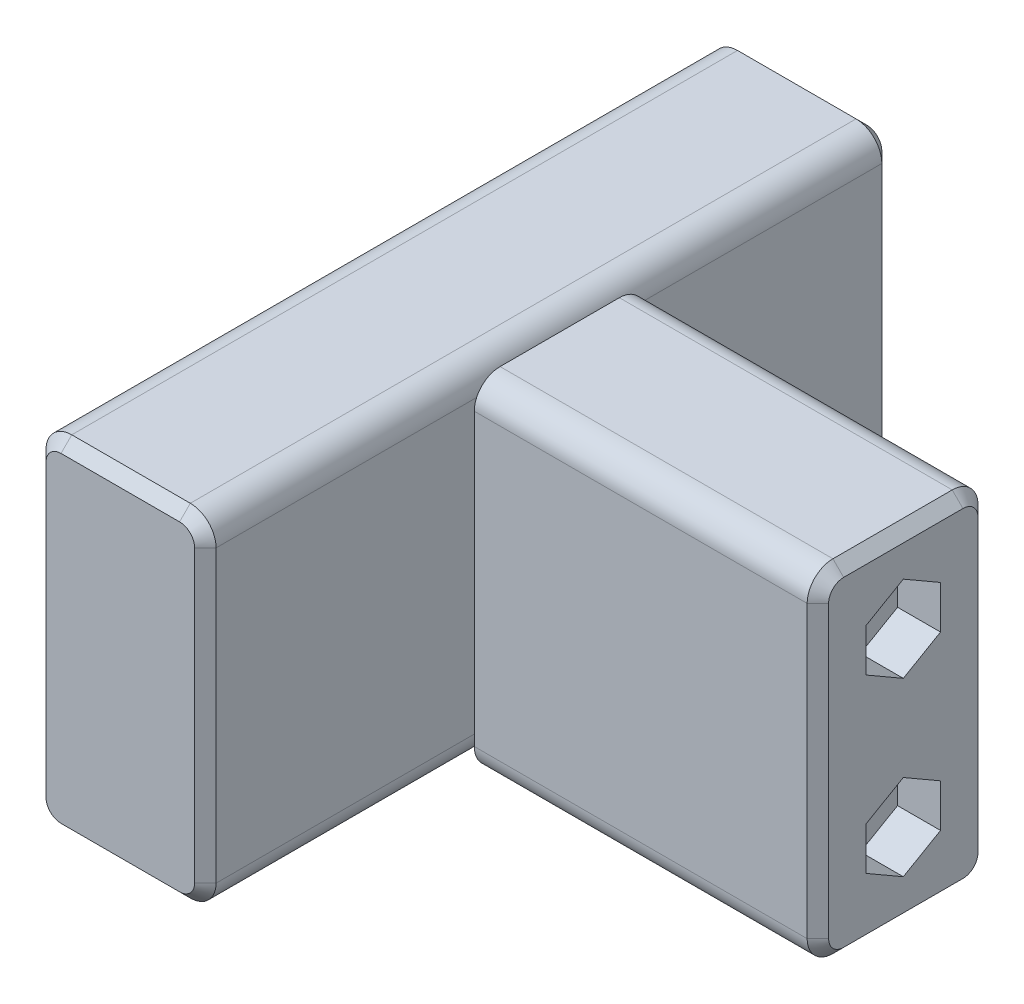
ISO-10303-21;
HEADER;
FILE_DESCRIPTION(('STEP AP214'),'2;1');
FILE_NAME('part.step','',(''),(''),'','','');
FILE_SCHEMA(('AUTOMOTIVE_DESIGN { 1 0 10303 214 1 1 1 1 }'));
ENDSEC;
DATA;
#1=APPLICATION_CONTEXT('core data for automotive mechanical design processes');
#2=APPLICATION_PROTOCOL_DEFINITION('international standard','automotive_design',2000,#1);
#3=PRODUCT_CONTEXT('',#1,'mechanical');
#4=PRODUCT('Part','Part','',(#3));
#5=PRODUCT_RELATED_PRODUCT_CATEGORY('part','',(#4));
#6=PRODUCT_DEFINITION_FORMATION('','',#4);
#7=PRODUCT_DEFINITION_CONTEXT('part definition',#1,'design');
#8=PRODUCT_DEFINITION('design','',#6,#7);
#9=PRODUCT_DEFINITION_SHAPE('','',#8);
#10=(LENGTH_UNIT() NAMED_UNIT(*) SI_UNIT(.MILLI.,.METRE.));
#11=(NAMED_UNIT(*) PLANE_ANGLE_UNIT() SI_UNIT($,.RADIAN.));
#12=(NAMED_UNIT(*) SI_UNIT($,.STERADIAN.) SOLID_ANGLE_UNIT());
#13=UNCERTAINTY_MEASURE_WITH_UNIT(LENGTH_MEASURE(1.E-05),#10,'distance_accuracy_value','');
#14=(GEOMETRIC_REPRESENTATION_CONTEXT(3) GLOBAL_UNCERTAINTY_ASSIGNED_CONTEXT((#13)) GLOBAL_UNIT_ASSIGNED_CONTEXT((#10,
#11,#12)) REPRESENTATION_CONTEXT('',''));
#15=CARTESIAN_POINT('',(0.,0.,0.));
#16=DIRECTION('',(0.,0.,1.));
#17=DIRECTION('',(1.,0.,0.));
#18=AXIS2_PLACEMENT_3D('',#15,#16,#17);
#19=CARTESIAN_POINT('',(64.9605,-12.7,0.));
#20=DIRECTION('',(-1.,0.,0.));
#21=DIRECTION('',(0.,0.,1.));
#22=AXIS2_PLACEMENT_3D('',#19,#20,#21);
#23=CYLINDRICAL_SURFACE('',#22,3.175);
#24=CARTESIAN_POINT('',(14.1605,-12.7,0.));
#25=DIRECTION('',(-1.,0.,0.));
#26=DIRECTION('',(0.,0.,1.));
#27=AXIS2_PLACEMENT_3D('',#24,#25,#26);
#28=CIRCLE('',#27,3.175);
#29=CARTESIAN_POINT('',(14.1605,-12.7,3.175));
#30=VERTEX_POINT('',#29);
#31=EDGE_CURVE('E368',#30,#30,#28,.T.);
#32=ORIENTED_EDGE('',*,*,#31,.T.);
#33=EDGE_LOOP('',(#32));
#34=FACE_BOUND('',#33,.T.);
#35=CARTESIAN_POINT('',(58.6105,-12.7,0.));
#36=DIRECTION('',(1.,0.,0.));
#37=DIRECTION('',(0.,0.,-1.));
#38=AXIS2_PLACEMENT_3D('',#35,#36,#37);
#39=CIRCLE('',#38,3.175);
#40=CARTESIAN_POINT('',(58.6105,-12.7,-3.175));
#41=VERTEX_POINT('',#40);
#42=EDGE_CURVE('E371',#41,#41,#39,.F.);
#43=ORIENTED_EDGE('',*,*,#42,.F.);
#44=EDGE_LOOP('',(#43));
#45=FACE_BOUND('',#44,.T.);
#46=ADVANCED_FACE('F55',(#34,#45),#23,.F.);
#47=CARTESIAN_POINT('',(64.9605,12.7,0.));
#48=DIRECTION('',(-1.,0.,0.));
#49=DIRECTION('',(0.,0.,1.));
#50=AXIS2_PLACEMENT_3D('',#47,#48,#49);
#51=CYLINDRICAL_SURFACE('',#50,3.175);
#52=CARTESIAN_POINT('',(14.1605,12.7,0.));
#53=DIRECTION('',(-1.,0.,0.));
#54=DIRECTION('',(0.,0.,1.));
#55=AXIS2_PLACEMENT_3D('',#52,#53,#54);
#56=CIRCLE('',#55,3.175);
#57=CARTESIAN_POINT('',(14.1605,12.7,3.17499999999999));
#58=VERTEX_POINT('',#57);
#59=EDGE_CURVE('E330',#58,#58,#56,.T.);
#60=ORIENTED_EDGE('',*,*,#59,.T.);
#61=EDGE_LOOP('',(#60));
#62=FACE_BOUND('',#61,.T.);
#63=CARTESIAN_POINT('',(58.6105,12.7,0.));
#64=DIRECTION('',(1.,0.,0.));
#65=DIRECTION('',(0.,0.,-1.));
#66=AXIS2_PLACEMENT_3D('',#63,#64,#65);
#67=CIRCLE('',#66,3.175);
#68=CARTESIAN_POINT('',(58.6105,12.7,-3.175));
#69=VERTEX_POINT('',#68);
#70=EDGE_CURVE('E271',#69,#69,#67,.F.);
#71=ORIENTED_EDGE('',*,*,#70,.F.);
#72=EDGE_LOOP('',(#71));
#73=FACE_BOUND('',#72,.T.);
#74=ADVANCED_FACE('F500',(#62,#73),#51,.F.);
#75=CARTESIAN_POINT('',(64.9605,-21.463,8.8185));
#76=DIRECTION('',(-1.,0.,0.));
#77=DIRECTION('',(0.,0.,1.));
#78=AXIS2_PLACEMENT_3D('',#75,#76,#77);
#79=CYLINDRICAL_SURFACE('',#78,3.81);
#80=DIRECTION('',(-1.,0.,0.));
#81=VECTOR('',#80,1.);
#82=CARTESIAN_POINT('',(64.9605,-25.273,8.8185));
#83=LINE('',#82,#81);
#84=CARTESIAN_POINT('',(63.373,-25.273,8.8185));
#85=VERTEX_POINT('',#84);
#86=CARTESIAN_POINT('',(14.1605,-25.273,8.8185));
#87=VERTEX_POINT('',#86);
#88=EDGE_CURVE('E365',#85,#87,#83,.T.);
#89=ORIENTED_EDGE('',*,*,#88,.F.);
#90=CARTESIAN_POINT('',(63.373,-21.463,8.8185));
#91=DIRECTION('',(-1.,0.,0.));
#92=DIRECTION('',(0.,0.,1.));
#93=AXIS2_PLACEMENT_3D('',#90,#91,#92);
#94=CIRCLE('',#93,3.81);
#95=CARTESIAN_POINT('',(63.373,-21.463,12.6285));
#96=VERTEX_POINT('',#95);
#97=EDGE_CURVE('E12',#85,#96,#94,.T.);
#98=ORIENTED_EDGE('',*,*,#97,.T.);
#99=DIRECTION('',(-1.,0.,0.));
#100=VECTOR('',#99,1.);
#101=CARTESIAN_POINT('',(64.9605,-21.463,12.6285));
#102=LINE('',#101,#100);
#103=CARTESIAN_POINT('',(14.1605,-21.463,12.6285));
#104=VERTEX_POINT('',#103);
#105=EDGE_CURVE('E351',#96,#104,#102,.T.);
#106=ORIENTED_EDGE('',*,*,#105,.T.);
#107=CARTESIAN_POINT('',(14.1605,-21.463,8.8185));
#108=DIRECTION('',(1.,0.,0.));
#109=DIRECTION('',(0.,0.,1.));
#110=AXIS2_PLACEMENT_3D('',#107,#108,#109);
#111=CIRCLE('',#110,3.81);
#112=EDGE_CURVE('E326',#104,#87,#111,.T.);
#113=ORIENTED_EDGE('',*,*,#112,.T.);
#114=EDGE_LOOP('',(#89,#98,#106,#113));
#115=FACE_BOUND('',#114,.T.);
#116=ADVANCED_FACE('F483',(#115),#79,.T.);
#117=CARTESIAN_POINT('',(64.9605,-25.273,8.8185));
#118=DIRECTION('',(0.,1.,0.));
#119=DIRECTION('',(0.,0.,1.));
#120=AXIS2_PLACEMENT_3D('',#117,#118,#119);
#121=PLANE('',#120);
#122=DIRECTION('',(-1.,0.,0.));
#123=VECTOR('',#122,1.);
#124=CARTESIAN_POINT('',(64.9605,-25.273,-8.8185));
#125=LINE('',#124,#123);
#126=CARTESIAN_POINT('',(63.373,-25.273,-8.8185));
#127=VERTEX_POINT('',#126);
#128=CARTESIAN_POINT('',(14.1605,-25.273,-8.8185));
#129=VERTEX_POINT('',#128);
#130=EDGE_CURVE('E363',#127,#129,#125,.T.);
#131=ORIENTED_EDGE('',*,*,#130,.F.);
#132=DIRECTION('',(0.,0.,1.));
#133=VECTOR('',#132,1.);
#134=CARTESIAN_POINT('',(63.373,-25.273,8.8185));
#135=LINE('',#134,#133);
#136=EDGE_CURVE('E65',#127,#85,#135,.T.);
#137=ORIENTED_EDGE('',*,*,#136,.T.);
#138=ORIENTED_EDGE('',*,*,#88,.T.);
#139=DIRECTION('',(0.,0.,-1.));
#140=VECTOR('',#139,1.);
#141=CARTESIAN_POINT('',(14.1605,-25.273,8.8185));
#142=LINE('',#141,#140);
#143=EDGE_CURVE('E329',#87,#129,#142,.T.);
#144=ORIENTED_EDGE('',*,*,#143,.T.);
#145=EDGE_LOOP('',(#131,#137,#138,#144));
#146=FACE_BOUND('',#145,.T.);
#147=ADVANCED_FACE('F530',(#146),#121,.F.);
#148=CARTESIAN_POINT('',(64.9605,-21.463,-8.8185));
#149=DIRECTION('',(-1.,0.,0.));
#150=DIRECTION('',(0.,0.,1.));
#151=AXIS2_PLACEMENT_3D('',#148,#149,#150);
#152=CYLINDRICAL_SURFACE('',#151,3.81);
#153=DIRECTION('',(-1.,0.,0.));
#154=VECTOR('',#153,1.);
#155=CARTESIAN_POINT('',(64.9605,-21.463,-12.6285));
#156=LINE('',#155,#154);
#157=CARTESIAN_POINT('',(63.373,-21.463,-12.6285));
#158=VERTEX_POINT('',#157);
#159=CARTESIAN_POINT('',(14.1605,-21.463,-12.6285));
#160=VERTEX_POINT('',#159);
#161=EDGE_CURVE('E361',#158,#160,#156,.T.);
#162=ORIENTED_EDGE('',*,*,#161,.F.);
#163=CARTESIAN_POINT('',(63.373,-21.463,-8.8185));
#164=DIRECTION('',(-1.,0.,0.));
#165=DIRECTION('',(0.,0.,1.));
#166=AXIS2_PLACEMENT_3D('',#163,#164,#165);
#167=CIRCLE('',#166,3.81);
#168=EDGE_CURVE('E80',#158,#127,#167,.T.);
#169=ORIENTED_EDGE('',*,*,#168,.T.);
#170=ORIENTED_EDGE('',*,*,#130,.T.);
#171=CARTESIAN_POINT('',(14.1605,-21.463,-8.8185));
#172=DIRECTION('',(1.,0.,0.));
#173=DIRECTION('',(0.,0.,-1.));
#174=AXIS2_PLACEMENT_3D('',#171,#172,#173);
#175=CIRCLE('',#174,3.81);
#176=EDGE_CURVE('E333',#129,#160,#175,.T.);
#177=ORIENTED_EDGE('',*,*,#176,.T.);
#178=EDGE_LOOP('',(#162,#169,#170,#177));
#179=FACE_BOUND('',#178,.T.);
#180=ADVANCED_FACE('F440',(#179),#152,.T.);
#181=CARTESIAN_POINT('',(64.9605,-21.463,-12.6285));
#182=DIRECTION('',(0.,0.,1.));
#183=DIRECTION('',(1.,0.,0.));
#184=AXIS2_PLACEMENT_3D('',#181,#182,#183);
#185=PLANE('',#184);
#186=DIRECTION('',(-1.,0.,0.));
#187=VECTOR('',#186,1.);
#188=CARTESIAN_POINT('',(64.9605,21.463,-12.6285));
#189=LINE('',#188,#187);
#190=CARTESIAN_POINT('',(63.373,21.463,-12.6285));
#191=VERTEX_POINT('',#190);
#192=CARTESIAN_POINT('',(14.1605,21.463,-12.6285));
#193=VERTEX_POINT('',#192);
#194=EDGE_CURVE('E359',#191,#193,#189,.T.);
#195=ORIENTED_EDGE('',*,*,#194,.F.);
#196=DIRECTION('',(0.,-1.,0.));
#197=VECTOR('',#196,1.);
#198=CARTESIAN_POINT('',(63.373,-21.463,-12.6285));
#199=LINE('',#198,#197);
#200=EDGE_CURVE('E403',#191,#158,#199,.T.);
#201=ORIENTED_EDGE('',*,*,#200,.T.);
#202=ORIENTED_EDGE('',*,*,#161,.T.);
#203=DIRECTION('',(0.,1.,0.));
#204=VECTOR('',#203,1.);
#205=CARTESIAN_POINT('',(14.1605,-21.463,-12.6285));
#206=LINE('',#205,#204);
#207=EDGE_CURVE('E336',#160,#193,#206,.T.);
#208=ORIENTED_EDGE('',*,*,#207,.T.);
#209=EDGE_LOOP('',(#195,#201,#202,#208));
#210=FACE_BOUND('',#209,.T.);
#211=ADVANCED_FACE('F439',(#210),#185,.F.);
#212=CARTESIAN_POINT('',(64.9605,21.463,-8.8185));
#213=DIRECTION('',(-1.,0.,0.));
#214=DIRECTION('',(0.,0.,1.));
#215=AXIS2_PLACEMENT_3D('',#212,#213,#214);
#216=CYLINDRICAL_SURFACE('',#215,3.81);
#217=DIRECTION('',(-1.,0.,0.));
#218=VECTOR('',#217,1.);
#219=CARTESIAN_POINT('',(64.9605,25.273,-8.8185));
#220=LINE('',#219,#218);
#221=CARTESIAN_POINT('',(63.373,25.273,-8.8185));
#222=VERTEX_POINT('',#221);
#223=CARTESIAN_POINT('',(14.1605,25.273,-8.8185));
#224=VERTEX_POINT('',#223);
#225=EDGE_CURVE('E357',#222,#224,#220,.T.);
#226=ORIENTED_EDGE('',*,*,#225,.F.);
#227=CARTESIAN_POINT('',(63.373,21.463,-8.8185));
#228=DIRECTION('',(-1.,0.,0.));
#229=DIRECTION('',(0.,0.,1.));
#230=AXIS2_PLACEMENT_3D('',#227,#228,#229);
#231=CIRCLE('',#230,3.81);
#232=EDGE_CURVE('E401',#222,#191,#231,.T.);
#233=ORIENTED_EDGE('',*,*,#232,.T.);
#234=ORIENTED_EDGE('',*,*,#194,.T.);
#235=CARTESIAN_POINT('',(14.1605,21.463,-8.8185));
#236=DIRECTION('',(1.,0.,0.));
#237=DIRECTION('',(0.,0.,1.));
#238=AXIS2_PLACEMENT_3D('',#235,#236,#237);
#239=CIRCLE('',#238,3.81);
#240=EDGE_CURVE('E339',#193,#224,#239,.T.);
#241=ORIENTED_EDGE('',*,*,#240,.T.);
#242=EDGE_LOOP('',(#226,#233,#234,#241));
#243=FACE_BOUND('',#242,.T.);
#244=ADVANCED_FACE('F452',(#243),#216,.T.);
#245=CARTESIAN_POINT('',(64.9605,25.273,8.8185));
#246=DIRECTION('',(0.,-1.,0.));
#247=DIRECTION('',(0.,0.,-1.));
#248=AXIS2_PLACEMENT_3D('',#245,#246,#247);
#249=PLANE('',#248);
#250=DIRECTION('',(-1.,0.,0.));
#251=VECTOR('',#250,1.);
#252=CARTESIAN_POINT('',(64.9605,25.273,8.8185));
#253=LINE('',#252,#251);
#254=CARTESIAN_POINT('',(63.373,25.273,8.8185));
#255=VERTEX_POINT('',#254);
#256=CARTESIAN_POINT('',(14.1605,25.273,8.8185));
#257=VERTEX_POINT('',#256);
#258=EDGE_CURVE('E355',#255,#257,#253,.T.);
#259=ORIENTED_EDGE('',*,*,#258,.F.);
#260=DIRECTION('',(0.,0.,-1.));
#261=VECTOR('',#260,1.);
#262=CARTESIAN_POINT('',(63.373,25.273,8.8185));
#263=LINE('',#262,#261);
#264=EDGE_CURVE('E399',#255,#222,#263,.T.);
#265=ORIENTED_EDGE('',*,*,#264,.T.);
#266=ORIENTED_EDGE('',*,*,#225,.T.);
#267=DIRECTION('',(0.,0.,1.));
#268=VECTOR('',#267,1.);
#269=CARTESIAN_POINT('',(14.1605,25.273,8.8185));
#270=LINE('',#269,#268);
#271=EDGE_CURVE('E342',#224,#257,#270,.T.);
#272=ORIENTED_EDGE('',*,*,#271,.T.);
#273=EDGE_LOOP('',(#259,#265,#266,#272));
#274=FACE_BOUND('',#273,.T.);
#275=ADVANCED_FACE('F455',(#274),#249,.F.);
#276=CARTESIAN_POINT('',(64.9605,21.463,8.8185));
#277=DIRECTION('',(-1.,0.,0.));
#278=DIRECTION('',(0.,0.,1.));
#279=AXIS2_PLACEMENT_3D('',#276,#277,#278);
#280=CYLINDRICAL_SURFACE('',#279,3.81);
#281=DIRECTION('',(-1.,0.,0.));
#282=VECTOR('',#281,1.);
#283=CARTESIAN_POINT('',(64.9605,21.463,12.6285));
#284=LINE('',#283,#282);
#285=CARTESIAN_POINT('',(63.373,21.463,12.6285));
#286=VERTEX_POINT('',#285);
#287=CARTESIAN_POINT('',(14.1605,21.463,12.6285));
#288=VERTEX_POINT('',#287);
#289=EDGE_CURVE('E353',#286,#288,#284,.T.);
#290=ORIENTED_EDGE('',*,*,#289,.F.);
#291=CARTESIAN_POINT('',(63.373,21.463,8.8185));
#292=DIRECTION('',(-1.,0.,0.));
#293=DIRECTION('',(0.,0.,1.));
#294=AXIS2_PLACEMENT_3D('',#291,#292,#293);
#295=CIRCLE('',#294,3.81);
#296=EDGE_CURVE('E397',#286,#255,#295,.T.);
#297=ORIENTED_EDGE('',*,*,#296,.T.);
#298=ORIENTED_EDGE('',*,*,#258,.T.);
#299=CARTESIAN_POINT('',(14.1605,21.463,8.8185));
#300=DIRECTION('',(1.,0.,0.));
#301=DIRECTION('',(0.,0.,1.));
#302=AXIS2_PLACEMENT_3D('',#299,#300,#301);
#303=CIRCLE('',#302,3.81);
#304=EDGE_CURVE('E345',#257,#288,#303,.T.);
#305=ORIENTED_EDGE('',*,*,#304,.T.);
#306=EDGE_LOOP('',(#290,#297,#298,#305));
#307=FACE_BOUND('',#306,.T.);
#308=ADVANCED_FACE('F518',(#307),#280,.T.);
#309=CARTESIAN_POINT('',(64.9605,-21.463,12.6285));
#310=DIRECTION('',(0.,0.,-1.));
#311=DIRECTION('',(-1.,0.,0.));
#312=AXIS2_PLACEMENT_3D('',#309,#310,#311);
#313=PLANE('',#312);
#314=ORIENTED_EDGE('',*,*,#105,.F.);
#315=DIRECTION('',(0.,1.,0.));
#316=VECTOR('',#315,1.);
#317=CARTESIAN_POINT('',(63.373,-21.463,12.6285));
#318=LINE('',#317,#316);
#319=EDGE_CURVE('E394',#96,#286,#318,.T.);
#320=ORIENTED_EDGE('',*,*,#319,.T.);
#321=ORIENTED_EDGE('',*,*,#289,.T.);
#322=DIRECTION('',(0.,-1.,0.));
#323=VECTOR('',#322,1.);
#324=CARTESIAN_POINT('',(14.1605,-21.463,12.6285));
#325=LINE('',#324,#323);
#326=EDGE_CURVE('E348',#288,#104,#325,.T.);
#327=ORIENTED_EDGE('',*,*,#326,.T.);
#328=EDGE_LOOP('',(#314,#320,#321,#327));
#329=FACE_BOUND('',#328,.T.);
#330=ADVANCED_FACE('F486',(#329),#313,.F.);
#331=CARTESIAN_POINT('',(64.9605,-21.463,8.8185));
#332=DIRECTION('',(-1.,0.,0.));
#333=DIRECTION('',(0.,0.,1.));
#334=AXIS2_PLACEMENT_3D('',#331,#332,#333);
#335=PLANE('',#334);
#336=CARTESIAN_POINT('',(64.9605,21.463,8.8185));
#337=DIRECTION('',(-1.,0.,0.));
#338=DIRECTION('',(0.,0.,1.));
#339=AXIS2_PLACEMENT_3D('',#336,#337,#338);
#340=CIRCLE('',#339,2.22250000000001);
#341=CARTESIAN_POINT('',(64.9605,23.6855,8.8185));
#342=VERTEX_POINT('',#341);
#343=CARTESIAN_POINT('',(64.9605,21.463,11.041));
#344=VERTEX_POINT('',#343);
#345=EDGE_CURVE('E389',#342,#344,#340,.F.);
#346=ORIENTED_EDGE('',*,*,#345,.T.);
#347=DIRECTION('',(0.,-1.,0.));
#348=VECTOR('',#347,1.);
#349=CARTESIAN_POINT('',(64.9605,-21.463,11.041));
#350=LINE('',#349,#348);
#351=CARTESIAN_POINT('',(64.9605,-21.463,11.041));
#352=VERTEX_POINT('',#351);
#353=EDGE_CURVE('E391',#344,#352,#350,.T.);
#354=ORIENTED_EDGE('',*,*,#353,.T.);
#355=CARTESIAN_POINT('',(64.9605,-21.463,8.8185));
#356=DIRECTION('',(-1.,0.,0.));
#357=DIRECTION('',(0.,0.,1.));
#358=AXIS2_PLACEMENT_3D('',#355,#356,#357);
#359=CIRCLE('',#358,2.22250000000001);
#360=CARTESIAN_POINT('',(64.9605,-23.6855,8.8185));
#361=VERTEX_POINT('',#360);
#362=EDGE_CURVE('E367',#352,#361,#359,.F.);
#363=ORIENTED_EDGE('',*,*,#362,.T.);
#364=DIRECTION('',(0.,0.,-1.));
#365=VECTOR('',#364,1.);
#366=CARTESIAN_POINT('',(64.9605,-23.6855,8.8185));
#367=LINE('',#366,#365);
#368=CARTESIAN_POINT('',(64.9605,-23.6855,-8.8185));
#369=VERTEX_POINT('',#368);
#370=EDGE_CURVE('E379',#361,#369,#367,.T.);
#371=ORIENTED_EDGE('',*,*,#370,.T.);
#372=CARTESIAN_POINT('',(64.9605,-21.463,-8.8185));
#373=DIRECTION('',(-1.,0.,0.));
#374=DIRECTION('',(0.,0.,1.));
#375=AXIS2_PLACEMENT_3D('',#372,#373,#374);
#376=CIRCLE('',#375,2.22250000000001);
#377=CARTESIAN_POINT('',(64.9605,-21.463,-11.041));
#378=VERTEX_POINT('',#377);
#379=EDGE_CURVE('E381',#369,#378,#376,.F.);
#380=ORIENTED_EDGE('',*,*,#379,.T.);
#381=DIRECTION('',(0.,1.,0.));
#382=VECTOR('',#381,1.);
#383=CARTESIAN_POINT('',(64.9605,-21.463,-11.041));
#384=LINE('',#383,#382);
#385=CARTESIAN_POINT('',(64.9605,21.463,-11.041));
#386=VERTEX_POINT('',#385);
#387=EDGE_CURVE('E383',#378,#386,#384,.T.);
#388=ORIENTED_EDGE('',*,*,#387,.T.);
#389=CARTESIAN_POINT('',(64.9605,21.463,-8.8185));
#390=DIRECTION('',(-1.,0.,0.));
#391=DIRECTION('',(0.,0.,1.));
#392=AXIS2_PLACEMENT_3D('',#389,#390,#391);
#393=CIRCLE('',#392,2.22250000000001);
#394=CARTESIAN_POINT('',(64.9605,23.6855,-8.8185));
#395=VERTEX_POINT('',#394);
#396=EDGE_CURVE('E385',#386,#395,#393,.F.);
#397=ORIENTED_EDGE('',*,*,#396,.T.);
#398=DIRECTION('',(0.,0.,1.));
#399=VECTOR('',#398,1.);
#400=CARTESIAN_POINT('',(64.9605,23.6855,8.8185));
#401=LINE('',#400,#399);
#402=EDGE_CURVE('E387',#395,#342,#401,.T.);
#403=ORIENTED_EDGE('',*,*,#402,.T.);
#404=EDGE_LOOP('',(#346,#354,#363,#371,#380,#388,#397,#403));
#405=FACE_BOUND('',#404,.T.);
#406=DIRECTION('',(0.,-0.5,0.866025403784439));
#407=VECTOR('',#406,1.);
#408=CARTESIAN_POINT('',(64.9605,19.0508529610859,0.));
#409=LINE('',#408,#407);
#410=CARTESIAN_POINT('',(64.9605,19.0508529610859,0.));
#411=VERTEX_POINT('',#410);
#412=CARTESIAN_POINT('',(64.9605,15.8754264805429,5.49999999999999));
#413=VERTEX_POINT('',#412);
#414=EDGE_CURVE('E258',#411,#413,#409,.T.);
#415=ORIENTED_EDGE('',*,*,#414,.F.);
#416=DIRECTION('',(0.,0.5,0.866025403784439));
#417=VECTOR('',#416,1.);
#418=CARTESIAN_POINT('',(64.9605,15.8754264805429,-5.5));
#419=LINE('',#418,#417);
#420=CARTESIAN_POINT('',(64.9605,15.8754264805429,-5.5));
#421=VERTEX_POINT('',#420);
#422=EDGE_CURVE('E225',#421,#411,#419,.T.);
#423=ORIENTED_EDGE('',*,*,#422,.F.);
#424=DIRECTION('',(0.,1.,0.));
#425=VECTOR('',#424,1.);
#426=CARTESIAN_POINT('',(64.9605,9.52457351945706,-5.5));
#427=LINE('',#426,#425);
#428=CARTESIAN_POINT('',(64.9605,9.52457351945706,-5.5));
#429=VERTEX_POINT('',#428);
#430=EDGE_CURVE('E244',#429,#421,#427,.T.);
#431=ORIENTED_EDGE('',*,*,#430,.F.);
#432=DIRECTION('',(0.,0.5,-0.866025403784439));
#433=VECTOR('',#432,1.);
#434=CARTESIAN_POINT('',(64.9605,6.34914703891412,0.));
#435=LINE('',#434,#433);
#436=CARTESIAN_POINT('',(64.9605,6.34914703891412,0.));
#437=VERTEX_POINT('',#436);
#438=EDGE_CURVE('E247',#437,#429,#435,.T.);
#439=ORIENTED_EDGE('',*,*,#438,.F.);
#440=DIRECTION('',(0.,-0.5,-0.866025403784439));
#441=VECTOR('',#440,1.);
#442=CARTESIAN_POINT('',(64.9605,9.52457351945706,5.49999999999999));
#443=LINE('',#442,#441);
#444=CARTESIAN_POINT('',(64.9605,9.52457351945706,5.49999999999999));
#445=VERTEX_POINT('',#444);
#446=EDGE_CURVE('E264',#445,#437,#443,.T.);
#447=ORIENTED_EDGE('',*,*,#446,.F.);
#448=DIRECTION('',(0.,-1.,0.));
#449=VECTOR('',#448,1.);
#450=CARTESIAN_POINT('',(64.9605,15.8754264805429,5.49999999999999));
#451=LINE('',#450,#449);
#452=EDGE_CURVE('E261',#413,#445,#451,.T.);
#453=ORIENTED_EDGE('',*,*,#452,.F.);
#454=EDGE_LOOP('',(#415,#423,#431,#439,#447,#453));
#455=FACE_BOUND('',#454,.T.);
#456=DIRECTION('',(0.,-0.5,0.866025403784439));
#457=VECTOR('',#456,1.);
#458=CARTESIAN_POINT('',(64.9605,-6.34914703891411,0.));
#459=LINE('',#458,#457);
#460=CARTESIAN_POINT('',(64.9605,-6.34914703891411,0.));
#461=VERTEX_POINT('',#460);
#462=CARTESIAN_POINT('',(64.9605,-9.52457351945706,5.5));
#463=VERTEX_POINT('',#462);
#464=EDGE_CURVE('E306',#461,#463,#459,.T.);
#465=ORIENTED_EDGE('',*,*,#464,.F.);
#466=DIRECTION('',(0.,0.5,0.866025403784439));
#467=VECTOR('',#466,1.);
#468=CARTESIAN_POINT('',(64.9605,-9.52457351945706,-5.5));
#469=LINE('',#468,#467);
#470=CARTESIAN_POINT('',(64.9605,-9.52457351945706,-5.5));
#471=VERTEX_POINT('',#470);
#472=EDGE_CURVE('E259',#471,#461,#469,.T.);
#473=ORIENTED_EDGE('',*,*,#472,.F.);
#474=DIRECTION('',(0.,1.,0.));
#475=VECTOR('',#474,1.);
#476=CARTESIAN_POINT('',(64.9605,-15.8754264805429,-5.5));
#477=LINE('',#476,#475);
#478=CARTESIAN_POINT('',(64.9605,-15.8754264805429,-5.5));
#479=VERTEX_POINT('',#478);
#480=EDGE_CURVE('E293',#479,#471,#477,.T.);
#481=ORIENTED_EDGE('',*,*,#480,.F.);
#482=DIRECTION('',(0.,0.5,-0.866025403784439));
#483=VECTOR('',#482,1.);
#484=CARTESIAN_POINT('',(64.9605,-19.0508529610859,0.));
#485=LINE('',#484,#483);
#486=CARTESIAN_POINT('',(64.9605,-19.0508529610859,0.));
#487=VERTEX_POINT('',#486);
#488=EDGE_CURVE('E296',#487,#479,#485,.T.);
#489=ORIENTED_EDGE('',*,*,#488,.F.);
#490=DIRECTION('',(0.,-0.5,-0.866025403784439));
#491=VECTOR('',#490,1.);
#492=CARTESIAN_POINT('',(64.9605,-15.8754264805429,5.5));
#493=LINE('',#492,#491);
#494=CARTESIAN_POINT('',(64.9605,-15.8754264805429,5.5));
#495=VERTEX_POINT('',#494);
#496=EDGE_CURVE('E300',#495,#487,#493,.T.);
#497=ORIENTED_EDGE('',*,*,#496,.F.);
#498=DIRECTION('',(0.,-1.,0.));
#499=VECTOR('',#498,1.);
#500=CARTESIAN_POINT('',(64.9605,-9.52457351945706,5.5));
#501=LINE('',#500,#499);
#502=EDGE_CURVE('E303',#463,#495,#501,.T.);
#503=ORIENTED_EDGE('',*,*,#502,.F.);
#504=EDGE_LOOP('',(#465,#473,#481,#489,#497,#503));
#505=FACE_BOUND('',#504,.T.);
#506=ADVANCED_FACE('F468',(#405,#455,#505),#335,.F.);
#507=CARTESIAN_POINT('',(14.1605,-21.463,8.8185));
#508=DIRECTION('',(-1.,0.,0.));
#509=DIRECTION('',(0.,0.,1.));
#510=AXIS2_PLACEMENT_3D('',#507,#508,#509);
#511=PLANE('',#510);
#512=ORIENTED_EDGE('',*,*,#59,.F.);
#513=EDGE_LOOP('',(#512));
#514=FACE_BOUND('',#513,.T.);
#515=ORIENTED_EDGE('',*,*,#31,.F.);
#516=EDGE_LOOP('',(#515));
#517=FACE_BOUND('',#516,.T.);
#518=ORIENTED_EDGE('',*,*,#112,.F.);
#519=ORIENTED_EDGE('',*,*,#326,.F.);
#520=ORIENTED_EDGE('',*,*,#304,.F.);
#521=ORIENTED_EDGE('',*,*,#271,.F.);
#522=ORIENTED_EDGE('',*,*,#240,.F.);
#523=ORIENTED_EDGE('',*,*,#207,.F.);
#524=ORIENTED_EDGE('',*,*,#176,.F.);
#525=ORIENTED_EDGE('',*,*,#143,.F.);
#526=EDGE_LOOP('',(#518,#519,#520,#521,#522,#523,#524,#525));
#527=FACE_BOUND('',#526,.T.);
#528=ADVANCED_FACE('F447',(#514,#517,#527),#511,.T.);
#529=CARTESIAN_POINT('',(58.6105,0.,0.));
#530=DIRECTION('',(1.,0.,0.));
#531=DIRECTION('',(0.,0.,-1.));
#532=AXIS2_PLACEMENT_3D('',#529,#530,#531);
#533=PLANE('',#532);
#534=DIRECTION('',(0.,0.5,0.866025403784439));
#535=VECTOR('',#534,1.);
#536=CARTESIAN_POINT('',(58.6105,15.8754264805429,-5.5));
#537=LINE('',#536,#535);
#538=CARTESIAN_POINT('',(58.6105,15.8754264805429,-5.5));
#539=VERTEX_POINT('',#538);
#540=CARTESIAN_POINT('',(58.6105,19.0508529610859,0.));
#541=VERTEX_POINT('',#540);
#542=EDGE_CURVE('E222',#539,#541,#537,.T.);
#543=ORIENTED_EDGE('',*,*,#542,.T.);
#544=DIRECTION('',(0.,-0.5,0.866025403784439));
#545=VECTOR('',#544,1.);
#546=CARTESIAN_POINT('',(58.6105,19.0508529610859,0.));
#547=LINE('',#546,#545);
#548=CARTESIAN_POINT('',(58.6105,15.8754264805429,5.49999999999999));
#549=VERTEX_POINT('',#548);
#550=EDGE_CURVE('E233',#541,#549,#547,.T.);
#551=ORIENTED_EDGE('',*,*,#550,.T.);
#552=DIRECTION('',(0.,-1.,0.));
#553=VECTOR('',#552,1.);
#554=CARTESIAN_POINT('',(58.6105,15.8754264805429,5.49999999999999));
#555=LINE('',#554,#553);
#556=CARTESIAN_POINT('',(58.6105,9.52457351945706,5.49999999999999));
#557=VERTEX_POINT('',#556);
#558=EDGE_CURVE('E238',#549,#557,#555,.T.);
#559=ORIENTED_EDGE('',*,*,#558,.T.);
#560=DIRECTION('',(0.,-0.5,-0.866025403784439));
#561=VECTOR('',#560,1.);
#562=CARTESIAN_POINT('',(58.6105,9.52457351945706,5.49999999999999));
#563=LINE('',#562,#561);
#564=CARTESIAN_POINT('',(58.6105,6.34914703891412,0.));
#565=VERTEX_POINT('',#564);
#566=EDGE_CURVE('E251',#557,#565,#563,.T.);
#567=ORIENTED_EDGE('',*,*,#566,.T.);
#568=DIRECTION('',(0.,0.5,-0.866025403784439));
#569=VECTOR('',#568,1.);
#570=CARTESIAN_POINT('',(58.6105,6.34914703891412,0.));
#571=LINE('',#570,#569);
#572=CARTESIAN_POINT('',(58.6105,9.52457351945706,-5.5));
#573=VERTEX_POINT('',#572);
#574=EDGE_CURVE('E254',#565,#573,#571,.T.);
#575=ORIENTED_EDGE('',*,*,#574,.T.);
#576=DIRECTION('',(0.,1.,0.));
#577=VECTOR('',#576,1.);
#578=CARTESIAN_POINT('',(58.6105,9.52457351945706,-5.5));
#579=LINE('',#578,#577);
#580=EDGE_CURVE('E230',#573,#539,#579,.T.);
#581=ORIENTED_EDGE('',*,*,#580,.T.);
#582=EDGE_LOOP('',(#543,#551,#559,#567,#575,#581));
#583=FACE_BOUND('',#582,.T.);
#584=ORIENTED_EDGE('',*,*,#70,.T.);
#585=EDGE_LOOP('',(#584));
#586=FACE_BOUND('',#585,.T.);
#587=ADVANCED_FACE('F240',(#583,#586),#533,.T.);
#588=CARTESIAN_POINT('',(58.6105,15.8754264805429,-5.5));
#589=DIRECTION('',(0.,0.866025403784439,-0.5));
#590=DIRECTION('',(0.,0.5,0.866025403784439));
#591=AXIS2_PLACEMENT_3D('',#588,#589,#590);
#592=PLANE('',#591);
#593=ORIENTED_EDGE('',*,*,#422,.T.);
#594=DIRECTION('',(1.,0.,0.));
#595=VECTOR('',#594,1.);
#596=CARTESIAN_POINT('',(58.6105,19.0508529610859,0.));
#597=LINE('',#596,#595);
#598=EDGE_CURVE('E218',#541,#411,#597,.T.);
#599=ORIENTED_EDGE('',*,*,#598,.F.);
#600=ORIENTED_EDGE('',*,*,#542,.F.);
#601=DIRECTION('',(1.,0.,0.));
#602=VECTOR('',#601,1.);
#603=CARTESIAN_POINT('',(58.6105,15.8754264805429,-5.5));
#604=LINE('',#603,#602);
#605=EDGE_CURVE('E269',#539,#421,#604,.T.);
#606=ORIENTED_EDGE('',*,*,#605,.T.);
#607=EDGE_LOOP('',(#593,#599,#600,#606));
#608=FACE_BOUND('',#607,.T.);
#609=ADVANCED_FACE('F220',(#608),#592,.F.);
#610=CARTESIAN_POINT('',(58.6105,9.52457351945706,-5.5));
#611=DIRECTION('',(0.,0.,-1.));
#612=DIRECTION('',(0.,1.,0.));
#613=AXIS2_PLACEMENT_3D('',#610,#611,#612);
#614=PLANE('',#613);
#615=ORIENTED_EDGE('',*,*,#430,.T.);
#616=ORIENTED_EDGE('',*,*,#605,.F.);
#617=ORIENTED_EDGE('',*,*,#580,.F.);
#618=DIRECTION('',(1.,0.,0.));
#619=VECTOR('',#618,1.);
#620=CARTESIAN_POINT('',(58.6105,9.52457351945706,-5.5));
#621=LINE('',#620,#619);
#622=EDGE_CURVE('E272',#573,#429,#621,.T.);
#623=ORIENTED_EDGE('',*,*,#622,.T.);
#624=EDGE_LOOP('',(#615,#616,#617,#623));
#625=FACE_BOUND('',#624,.T.);
#626=ADVANCED_FACE('F729',(#625),#614,.F.);
#627=CARTESIAN_POINT('',(58.6105,6.34914703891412,0.));
#628=DIRECTION('',(0.,-0.866025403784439,-0.5));
#629=DIRECTION('',(0.,0.5,-0.866025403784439));
#630=AXIS2_PLACEMENT_3D('',#627,#628,#629);
#631=PLANE('',#630);
#632=ORIENTED_EDGE('',*,*,#438,.T.);
#633=ORIENTED_EDGE('',*,*,#622,.F.);
#634=ORIENTED_EDGE('',*,*,#574,.F.);
#635=DIRECTION('',(1.,0.,0.));
#636=VECTOR('',#635,1.);
#637=CARTESIAN_POINT('',(58.6105,6.34914703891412,0.));
#638=LINE('',#637,#636);
#639=EDGE_CURVE('E274',#565,#437,#638,.T.);
#640=ORIENTED_EDGE('',*,*,#639,.T.);
#641=EDGE_LOOP('',(#632,#633,#634,#640));
#642=FACE_BOUND('',#641,.T.);
#643=ADVANCED_FACE('F720',(#642),#631,.F.);
#644=CARTESIAN_POINT('',(58.6105,9.52457351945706,5.49999999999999));
#645=DIRECTION('',(0.,-0.866025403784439,0.5));
#646=DIRECTION('',(0.,-0.5,-0.866025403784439));
#647=AXIS2_PLACEMENT_3D('',#644,#645,#646);
#648=PLANE('',#647);
#649=ORIENTED_EDGE('',*,*,#446,.T.);
#650=ORIENTED_EDGE('',*,*,#639,.F.);
#651=ORIENTED_EDGE('',*,*,#566,.F.);
#652=DIRECTION('',(1.,0.,0.));
#653=VECTOR('',#652,1.);
#654=CARTESIAN_POINT('',(58.6105,9.52457351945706,5.49999999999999));
#655=LINE('',#654,#653);
#656=EDGE_CURVE('E276',#557,#445,#655,.T.);
#657=ORIENTED_EDGE('',*,*,#656,.T.);
#658=EDGE_LOOP('',(#649,#650,#651,#657));
#659=FACE_BOUND('',#658,.T.);
#660=ADVANCED_FACE('F711',(#659),#648,.F.);
#661=CARTESIAN_POINT('',(58.6105,15.8754264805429,5.49999999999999));
#662=DIRECTION('',(0.,0.,1.));
#663=DIRECTION('',(0.,-1.,0.));
#664=AXIS2_PLACEMENT_3D('',#661,#662,#663);
#665=PLANE('',#664);
#666=ORIENTED_EDGE('',*,*,#452,.T.);
#667=ORIENTED_EDGE('',*,*,#656,.F.);
#668=ORIENTED_EDGE('',*,*,#558,.F.);
#669=DIRECTION('',(1.,0.,0.));
#670=VECTOR('',#669,1.);
#671=CARTESIAN_POINT('',(58.6105,15.8754264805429,5.49999999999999));
#672=LINE('',#671,#670);
#673=EDGE_CURVE('E229',#549,#413,#672,.T.);
#674=ORIENTED_EDGE('',*,*,#673,.T.);
#675=EDGE_LOOP('',(#666,#667,#668,#674));
#676=FACE_BOUND('',#675,.T.);
#677=ADVANCED_FACE('F703',(#676),#665,.F.);
#678=CARTESIAN_POINT('',(58.6105,19.0508529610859,0.));
#679=DIRECTION('',(0.,0.866025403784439,0.5));
#680=DIRECTION('',(0.,-0.5,0.866025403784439));
#681=AXIS2_PLACEMENT_3D('',#678,#679,#680);
#682=PLANE('',#681);
#683=ORIENTED_EDGE('',*,*,#414,.T.);
#684=ORIENTED_EDGE('',*,*,#673,.F.);
#685=ORIENTED_EDGE('',*,*,#550,.F.);
#686=ORIENTED_EDGE('',*,*,#598,.T.);
#687=EDGE_LOOP('',(#683,#684,#685,#686));
#688=FACE_BOUND('',#687,.T.);
#689=ADVANCED_FACE('F234',(#688),#682,.F.);
#690=CARTESIAN_POINT('',(58.6105,0.,0.));
#691=DIRECTION('',(1.,0.,0.));
#692=DIRECTION('',(0.,0.,-1.));
#693=AXIS2_PLACEMENT_3D('',#690,#691,#692);
#694=PLANE('',#693);
#695=DIRECTION('',(0.,0.5,0.866025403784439));
#696=VECTOR('',#695,1.);
#697=CARTESIAN_POINT('',(58.6105,-9.52457351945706,-5.5));
#698=LINE('',#697,#696);
#699=CARTESIAN_POINT('',(58.6105,-9.52457351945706,-5.5));
#700=VERTEX_POINT('',#699);
#701=CARTESIAN_POINT('',(58.6105,-6.34914703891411,0.));
#702=VERTEX_POINT('',#701);
#703=EDGE_CURVE('E297',#700,#702,#698,.T.);
#704=ORIENTED_EDGE('',*,*,#703,.T.);
#705=DIRECTION('',(0.,-0.5,0.866025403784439));
#706=VECTOR('',#705,1.);
#707=CARTESIAN_POINT('',(58.6105,-6.34914703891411,0.));
#708=LINE('',#707,#706);
#709=CARTESIAN_POINT('',(58.6105,-9.52457351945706,5.5));
#710=VERTEX_POINT('',#709);
#711=EDGE_CURVE('E321',#702,#710,#708,.T.);
#712=ORIENTED_EDGE('',*,*,#711,.T.);
#713=DIRECTION('',(0.,-1.,0.));
#714=VECTOR('',#713,1.);
#715=CARTESIAN_POINT('',(58.6105,-9.52457351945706,5.5));
#716=LINE('',#715,#714);
#717=CARTESIAN_POINT('',(58.6105,-15.8754264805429,5.5));
#718=VERTEX_POINT('',#717);
#719=EDGE_CURVE('E318',#710,#718,#716,.T.);
#720=ORIENTED_EDGE('',*,*,#719,.T.);
#721=DIRECTION('',(0.,-0.5,-0.866025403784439));
#722=VECTOR('',#721,1.);
#723=CARTESIAN_POINT('',(58.6105,-15.8754264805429,5.5));
#724=LINE('',#723,#722);
#725=CARTESIAN_POINT('',(58.6105,-19.0508529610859,0.));
#726=VERTEX_POINT('',#725);
#727=EDGE_CURVE('E315',#718,#726,#724,.T.);
#728=ORIENTED_EDGE('',*,*,#727,.T.);
#729=DIRECTION('',(0.,0.5,-0.866025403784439));
#730=VECTOR('',#729,1.);
#731=CARTESIAN_POINT('',(58.6105,-19.0508529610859,0.));
#732=LINE('',#731,#730);
#733=CARTESIAN_POINT('',(58.6105,-15.8754264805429,-5.5));
#734=VERTEX_POINT('',#733);
#735=EDGE_CURVE('E312',#726,#734,#732,.T.);
#736=ORIENTED_EDGE('',*,*,#735,.T.);
#737=DIRECTION('',(0.,1.,0.));
#738=VECTOR('',#737,1.);
#739=CARTESIAN_POINT('',(58.6105,-15.8754264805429,-5.5));
#740=LINE('',#739,#738);
#741=EDGE_CURVE('E282',#734,#700,#740,.T.);
#742=ORIENTED_EDGE('',*,*,#741,.T.);
#743=EDGE_LOOP('',(#704,#712,#720,#728,#736,#742));
#744=FACE_BOUND('',#743,.T.);
#745=ORIENTED_EDGE('',*,*,#42,.T.);
#746=EDGE_LOOP('',(#745));
#747=FACE_BOUND('',#746,.T.);
#748=ADVANCED_FACE('F687',(#744,#747),#694,.T.);
#749=CARTESIAN_POINT('',(58.6105,-9.52457351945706,-5.5));
#750=DIRECTION('',(0.,0.866025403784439,-0.5));
#751=DIRECTION('',(0.,0.5,0.866025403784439));
#752=AXIS2_PLACEMENT_3D('',#749,#750,#751);
#753=PLANE('',#752);
#754=ORIENTED_EDGE('',*,*,#472,.T.);
#755=DIRECTION('',(1.,0.,0.));
#756=VECTOR('',#755,1.);
#757=CARTESIAN_POINT('',(58.6105,-6.34914703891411,0.));
#758=LINE('',#757,#756);
#759=EDGE_CURVE('E279',#702,#461,#758,.T.);
#760=ORIENTED_EDGE('',*,*,#759,.F.);
#761=ORIENTED_EDGE('',*,*,#703,.F.);
#762=DIRECTION('',(1.,0.,0.));
#763=VECTOR('',#762,1.);
#764=CARTESIAN_POINT('',(58.6105,-9.52457351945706,-5.5));
#765=LINE('',#764,#763);
#766=EDGE_CURVE('E291',#700,#471,#765,.T.);
#767=ORIENTED_EDGE('',*,*,#766,.T.);
#768=EDGE_LOOP('',(#754,#760,#761,#767));
#769=FACE_BOUND('',#768,.T.);
#770=ADVANCED_FACE('F678',(#769),#753,.F.);
#771=CARTESIAN_POINT('',(58.6105,-15.8754264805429,-5.5));
#772=DIRECTION('',(0.,0.,-1.));
#773=DIRECTION('',(0.,1.,0.));
#774=AXIS2_PLACEMENT_3D('',#771,#772,#773);
#775=PLANE('',#774);
#776=ORIENTED_EDGE('',*,*,#480,.T.);
#777=ORIENTED_EDGE('',*,*,#766,.F.);
#778=ORIENTED_EDGE('',*,*,#741,.F.);
#779=DIRECTION('',(1.,0.,0.));
#780=VECTOR('',#779,1.);
#781=CARTESIAN_POINT('',(58.6105,-15.8754264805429,-5.5));
#782=LINE('',#781,#780);
#783=EDGE_CURVE('E289',#734,#479,#782,.T.);
#784=ORIENTED_EDGE('',*,*,#783,.T.);
#785=EDGE_LOOP('',(#776,#777,#778,#784));
#786=FACE_BOUND('',#785,.T.);
#787=ADVANCED_FACE('F669',(#786),#775,.F.);
#788=CARTESIAN_POINT('',(58.6105,-19.0508529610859,0.));
#789=DIRECTION('',(0.,-0.866025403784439,-0.5));
#790=DIRECTION('',(0.,0.5,-0.866025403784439));
#791=AXIS2_PLACEMENT_3D('',#788,#789,#790);
#792=PLANE('',#791);
#793=ORIENTED_EDGE('',*,*,#488,.T.);
#794=ORIENTED_EDGE('',*,*,#783,.F.);
#795=ORIENTED_EDGE('',*,*,#735,.F.);
#796=DIRECTION('',(1.,0.,0.));
#797=VECTOR('',#796,1.);
#798=CARTESIAN_POINT('',(58.6105,-19.0508529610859,0.));
#799=LINE('',#798,#797);
#800=EDGE_CURVE('E287',#726,#487,#799,.T.);
#801=ORIENTED_EDGE('',*,*,#800,.T.);
#802=EDGE_LOOP('',(#793,#794,#795,#801));
#803=FACE_BOUND('',#802,.T.);
#804=ADVANCED_FACE('F660',(#803),#792,.F.);
#805=CARTESIAN_POINT('',(58.6105,-15.8754264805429,5.5));
#806=DIRECTION('',(0.,-0.866025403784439,0.5));
#807=DIRECTION('',(0.,-0.5,-0.866025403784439));
#808=AXIS2_PLACEMENT_3D('',#805,#806,#807);
#809=PLANE('',#808);
#810=ORIENTED_EDGE('',*,*,#496,.T.);
#811=ORIENTED_EDGE('',*,*,#800,.F.);
#812=ORIENTED_EDGE('',*,*,#727,.F.);
#813=DIRECTION('',(1.,0.,0.));
#814=VECTOR('',#813,1.);
#815=CARTESIAN_POINT('',(58.6105,-15.8754264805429,5.5));
#816=LINE('',#815,#814);
#817=EDGE_CURVE('E285',#718,#495,#816,.T.);
#818=ORIENTED_EDGE('',*,*,#817,.T.);
#819=EDGE_LOOP('',(#810,#811,#812,#818));
#820=FACE_BOUND('',#819,.T.);
#821=ADVANCED_FACE('F651',(#820),#809,.F.);
#822=CARTESIAN_POINT('',(58.6105,-9.52457351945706,5.5));
#823=DIRECTION('',(0.,0.,1.));
#824=DIRECTION('',(0.,-1.,0.));
#825=AXIS2_PLACEMENT_3D('',#822,#823,#824);
#826=PLANE('',#825);
#827=ORIENTED_EDGE('',*,*,#502,.T.);
#828=ORIENTED_EDGE('',*,*,#817,.F.);
#829=ORIENTED_EDGE('',*,*,#719,.F.);
#830=DIRECTION('',(1.,0.,0.));
#831=VECTOR('',#830,1.);
#832=CARTESIAN_POINT('',(58.6105,-9.52457351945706,5.5));
#833=LINE('',#832,#831);
#834=EDGE_CURVE('E283',#710,#463,#833,.T.);
#835=ORIENTED_EDGE('',*,*,#834,.T.);
#836=EDGE_LOOP('',(#827,#828,#829,#835));
#837=FACE_BOUND('',#836,.T.);
#838=ADVANCED_FACE('F643',(#837),#826,.F.);
#839=CARTESIAN_POINT('',(58.6105,-6.34914703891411,0.));
#840=DIRECTION('',(0.,0.866025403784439,0.5));
#841=DIRECTION('',(0.,-0.5,0.866025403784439));
#842=AXIS2_PLACEMENT_3D('',#839,#840,#841);
#843=PLANE('',#842);
#844=ORIENTED_EDGE('',*,*,#464,.T.);
#845=ORIENTED_EDGE('',*,*,#834,.F.);
#846=ORIENTED_EDGE('',*,*,#711,.F.);
#847=ORIENTED_EDGE('',*,*,#759,.T.);
#848=EDGE_LOOP('',(#844,#845,#846,#847));
#849=FACE_BOUND('',#848,.T.);
#850=ADVANCED_FACE('F540',(#849),#843,.F.);
#851=CARTESIAN_POINT('',(64.9605,-21.463,-11.041));
#852=DIRECTION('',(-0.707106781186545,0.,0.70710678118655));
#853=DIRECTION('',(0.,1.,0.));
#854=AXIS2_PLACEMENT_3D('',#851,#852,#853);
#855=PLANE('',#854);
#856=DIRECTION('',(0.70710678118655,0.,0.707106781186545));
#857=VECTOR('',#856,1.);
#858=CARTESIAN_POINT('',(63.373,-21.463,-12.6285));
#859=LINE('',#858,#857);
#860=EDGE_CURVE('E422',#158,#378,#859,.T.);
#861=ORIENTED_EDGE('',*,*,#860,.F.);
#862=ORIENTED_EDGE('',*,*,#200,.F.);
#863=DIRECTION('',(-0.70710678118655,0.,-0.707106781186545));
#864=VECTOR('',#863,1.);
#865=CARTESIAN_POINT('',(64.9605,21.463,-11.041));
#866=LINE('',#865,#864);
#867=EDGE_CURVE('E60',#386,#191,#866,.T.);
#868=ORIENTED_EDGE('',*,*,#867,.F.);
#869=ORIENTED_EDGE('',*,*,#387,.F.);
#870=EDGE_LOOP('',(#861,#862,#868,#869));
#871=FACE_BOUND('',#870,.T.);
#872=ADVANCED_FACE('F58',(#871),#855,.F.);
#873=CARTESIAN_POINT('',(64.9605,21.463,-8.8185));
#874=DIRECTION('',(-1.,0.,0.));
#875=DIRECTION('',(0.,0.,1.));
#876=AXIS2_PLACEMENT_3D('',#873,#874,#875);
#877=CONICAL_SURFACE('',#876,2.22250000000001,0.785398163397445);
#878=ORIENTED_EDGE('',*,*,#867,.T.);
#879=ORIENTED_EDGE('',*,*,#232,.F.);
#880=DIRECTION('',(-0.70710678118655,0.707106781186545,0.));
#881=VECTOR('',#880,1.);
#882=CARTESIAN_POINT('',(64.9605,23.6855,-8.8185));
#883=LINE('',#882,#881);
#884=EDGE_CURVE('E420',#395,#222,#883,.T.);
#885=ORIENTED_EDGE('',*,*,#884,.F.);
#886=ORIENTED_EDGE('',*,*,#396,.F.);
#887=EDGE_LOOP('',(#878,#879,#885,#886));
#888=FACE_BOUND('',#887,.T.);
#889=ADVANCED_FACE('F432',(#888),#877,.T.);
#890=CARTESIAN_POINT('',(64.9605,-21.463,-8.8185));
#891=DIRECTION('',(-1.,0.,0.));
#892=DIRECTION('',(0.,0.,1.));
#893=AXIS2_PLACEMENT_3D('',#890,#891,#892);
#894=CONICAL_SURFACE('',#893,2.22250000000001,0.785398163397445);
#895=ORIENTED_EDGE('',*,*,#860,.T.);
#896=ORIENTED_EDGE('',*,*,#379,.F.);
#897=DIRECTION('',(0.70710678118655,0.707106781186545,0.));
#898=VECTOR('',#897,1.);
#899=CARTESIAN_POINT('',(63.373,-25.273,-8.8185));
#900=LINE('',#899,#898);
#901=EDGE_CURVE('E417',#127,#369,#900,.T.);
#902=ORIENTED_EDGE('',*,*,#901,.F.);
#903=ORIENTED_EDGE('',*,*,#168,.F.);
#904=EDGE_LOOP('',(#895,#896,#902,#903));
#905=FACE_BOUND('',#904,.T.);
#906=ADVANCED_FACE('F472',(#905),#894,.T.);
#907=CARTESIAN_POINT('',(64.9605,23.6855,8.8185));
#908=DIRECTION('',(-0.707106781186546,-0.707106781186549,0.));
#909=DIRECTION('',(0.,0.,1.));
#910=AXIS2_PLACEMENT_3D('',#907,#908,#909);
#911=PLANE('',#910);
#912=ORIENTED_EDGE('',*,*,#884,.T.);
#913=ORIENTED_EDGE('',*,*,#264,.F.);
#914=DIRECTION('',(-0.707106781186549,0.707106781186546,0.));
#915=VECTOR('',#914,1.);
#916=CARTESIAN_POINT('',(64.9605,23.6855,8.8185));
#917=LINE('',#916,#915);
#918=EDGE_CURVE('E414',#342,#255,#917,.T.);
#919=ORIENTED_EDGE('',*,*,#918,.F.);
#920=ORIENTED_EDGE('',*,*,#402,.F.);
#921=EDGE_LOOP('',(#912,#913,#919,#920));
#922=FACE_BOUND('',#921,.T.);
#923=ADVANCED_FACE('F459',(#922),#911,.F.);
#924=CARTESIAN_POINT('',(64.9605,-23.6855,8.8185));
#925=DIRECTION('',(-0.707106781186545,0.70710678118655,0.));
#926=DIRECTION('',(0.,0.,-1.));
#927=AXIS2_PLACEMENT_3D('',#924,#925,#926);
#928=PLANE('',#927);
#929=ORIENTED_EDGE('',*,*,#901,.T.);
#930=ORIENTED_EDGE('',*,*,#370,.F.);
#931=DIRECTION('',(0.70710678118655,0.707106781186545,0.));
#932=VECTOR('',#931,1.);
#933=CARTESIAN_POINT('',(63.373,-25.273,8.8185));
#934=LINE('',#933,#932);
#935=EDGE_CURVE('E411',#85,#361,#934,.T.);
#936=ORIENTED_EDGE('',*,*,#935,.F.);
#937=ORIENTED_EDGE('',*,*,#136,.F.);
#938=EDGE_LOOP('',(#929,#930,#936,#937));
#939=FACE_BOUND('',#938,.T.);
#940=ADVANCED_FACE('F474',(#939),#928,.F.);
#941=CARTESIAN_POINT('',(64.9605,21.463,8.8185));
#942=DIRECTION('',(-1.,0.,0.));
#943=DIRECTION('',(0.,0.,1.));
#944=AXIS2_PLACEMENT_3D('',#941,#942,#943);
#945=CONICAL_SURFACE('',#944,2.22250000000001,0.785398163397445);
#946=ORIENTED_EDGE('',*,*,#918,.T.);
#947=ORIENTED_EDGE('',*,*,#296,.F.);
#948=DIRECTION('',(-0.70710678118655,0.,0.707106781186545));
#949=VECTOR('',#948,1.);
#950=CARTESIAN_POINT('',(64.9605,21.463,11.041));
#951=LINE('',#950,#949);
#952=EDGE_CURVE('E409',#344,#286,#951,.T.);
#953=ORIENTED_EDGE('',*,*,#952,.F.);
#954=ORIENTED_EDGE('',*,*,#345,.F.);
#955=EDGE_LOOP('',(#946,#947,#953,#954));
#956=FACE_BOUND('',#955,.T.);
#957=ADVANCED_FACE('F464',(#956),#945,.T.);
#958=CARTESIAN_POINT('',(64.9605,-21.463,8.8185));
#959=DIRECTION('',(-1.,0.,0.));
#960=DIRECTION('',(0.,0.,1.));
#961=AXIS2_PLACEMENT_3D('',#958,#959,#960);
#962=CONICAL_SURFACE('',#961,2.22250000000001,0.785398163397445);
#963=ORIENTED_EDGE('',*,*,#935,.T.);
#964=ORIENTED_EDGE('',*,*,#362,.F.);
#965=DIRECTION('',(0.70710678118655,0.,-0.707106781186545));
#966=VECTOR('',#965,1.);
#967=CARTESIAN_POINT('',(63.373,-21.463,12.6285));
#968=LINE('',#967,#966);
#969=EDGE_CURVE('E407',#96,#352,#968,.T.);
#970=ORIENTED_EDGE('',*,*,#969,.F.);
#971=ORIENTED_EDGE('',*,*,#97,.F.);
#972=EDGE_LOOP('',(#963,#964,#970,#971));
#973=FACE_BOUND('',#972,.T.);
#974=ADVANCED_FACE('F480',(#973),#962,.T.);
#975=CARTESIAN_POINT('',(64.9605,-21.463,11.041));
#976=DIRECTION('',(-0.707106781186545,0.,-0.70710678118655));
#977=DIRECTION('',(0.,-1.,0.));
#978=AXIS2_PLACEMENT_3D('',#975,#976,#977);
#979=PLANE('',#978);
#980=ORIENTED_EDGE('',*,*,#952,.T.);
#981=ORIENTED_EDGE('',*,*,#319,.F.);
#982=ORIENTED_EDGE('',*,*,#969,.T.);
#983=ORIENTED_EDGE('',*,*,#353,.F.);
#984=EDGE_LOOP('',(#980,#981,#982,#983));
#985=FACE_BOUND('',#984,.T.);
#986=ADVANCED_FACE('F490',(#985),#979,.F.);
#987=CLOSED_SHELL('',(#46,#74,#116,#147,#180,#211,#244,#275,#308,#330,#506,#528,#587,#609,#626,
#643,#660,#677,#689,#748,#770,#787,#804,#821,#838,#850,#872,#889,#906,#923,#940,#957,#974,#986));
#988=MANIFOLD_SOLID_BREP('B2',#987);
#989=CARTESIAN_POINT('',(-8.763,-21.463,50.8));
#990=DIRECTION('',(0.,0.,-1.));
#991=DIRECTION('',(-1.,0.,0.));
#992=AXIS2_PLACEMENT_3D('',#989,#990,#991);
#993=CYLINDRICAL_SURFACE('',#992,3.81);
#994=DIRECTION('',(0.,0.,-1.));
#995=VECTOR('',#994,1.);
#996=CARTESIAN_POINT('',(-12.573,-21.463,50.8));
#997=LINE('',#996,#995);
#998=CARTESIAN_POINT('',(-12.573,-21.463,49.2125));
#999=VERTEX_POINT('',#998);
#1000=CARTESIAN_POINT('',(-12.573,-21.463,-49.2125));
#1001=VERTEX_POINT('',#1000);
#1002=EDGE_CURVE('E1116',#999,#1001,#997,.T.);
#1003=ORIENTED_EDGE('',*,*,#1002,.T.);
#1004=CARTESIAN_POINT('',(-8.763,-21.463,-49.2125));
#1005=DIRECTION('',(0.,0.,-1.));
#1006=DIRECTION('',(-1.,0.,0.));
#1007=AXIS2_PLACEMENT_3D('',#1004,#1005,#1006);
#1008=CIRCLE('',#1007,3.81);
#1009=CARTESIAN_POINT('',(-8.763,-25.273,-49.2125));
#1010=VERTEX_POINT('',#1009);
#1011=EDGE_CURVE('E1041',#1001,#1010,#1008,.F.);
#1012=ORIENTED_EDGE('',*,*,#1011,.T.);
#1013=DIRECTION('',(0.,0.,-1.));
#1014=VECTOR('',#1013,1.);
#1015=CARTESIAN_POINT('',(-8.763,-25.273,50.8));
#1016=LINE('',#1015,#1014);
#1017=CARTESIAN_POINT('',(-8.763,-25.273,49.2125));
#1018=VERTEX_POINT('',#1017);
#1019=EDGE_CURVE('E980',#1018,#1010,#1016,.T.);
#1020=ORIENTED_EDGE('',*,*,#1019,.F.);
#1021=CARTESIAN_POINT('',(-8.763,-21.463,49.2125));
#1022=DIRECTION('',(0.,0.,-1.));
#1023=DIRECTION('',(-1.,0.,0.));
#1024=AXIS2_PLACEMENT_3D('',#1021,#1022,#1023);
#1025=CIRCLE('',#1024,3.81);
#1026=EDGE_CURVE('E1039',#1018,#999,#1025,.T.);
#1027=ORIENTED_EDGE('',*,*,#1026,.T.);
#1028=EDGE_LOOP('',(#1003,#1012,#1020,#1027));
#1029=FACE_BOUND('',#1028,.T.);
#1030=ADVANCED_FACE('F843',(#1029),#993,.T.);
#1031=CARTESIAN_POINT('',(-8.763,-25.273,50.8));
#1032=DIRECTION('',(0.,1.,0.));
#1033=DIRECTION('',(0.,0.,1.));
#1034=AXIS2_PLACEMENT_3D('',#1031,#1032,#1033);
#1035=PLANE('',#1034);
#1036=ORIENTED_EDGE('',*,*,#1019,.T.);
#1037=DIRECTION('',(1.,0.,0.));
#1038=VECTOR('',#1037,1.);
#1039=CARTESIAN_POINT('',(8.763,-25.273,-49.2125));
#1040=LINE('',#1039,#1038);
#1041=CARTESIAN_POINT('',(8.763,-25.273,-49.2125));
#1042=VERTEX_POINT('',#1041);
#1043=EDGE_CURVE('E979',#1010,#1042,#1040,.T.);
#1044=ORIENTED_EDGE('',*,*,#1043,.T.);
#1045=DIRECTION('',(0.,0.,-1.));
#1046=VECTOR('',#1045,1.);
#1047=CARTESIAN_POINT('',(8.763,-25.273,50.8));
#1048=LINE('',#1047,#1046);
#1049=CARTESIAN_POINT('',(8.763,-25.273,49.2125));
#1050=VERTEX_POINT('',#1049);
#1051=EDGE_CURVE('E961',#1050,#1042,#1048,.T.);
#1052=ORIENTED_EDGE('',*,*,#1051,.F.);
#1053=DIRECTION('',(-1.,0.,0.));
#1054=VECTOR('',#1053,1.);
#1055=CARTESIAN_POINT('',(-8.763,-25.273,49.2125));
#1056=LINE('',#1055,#1054);
#1057=EDGE_CURVE('E976',#1050,#1018,#1056,.T.);
#1058=ORIENTED_EDGE('',*,*,#1057,.T.);
#1059=EDGE_LOOP('',(#1036,#1044,#1052,#1058));
#1060=FACE_BOUND('',#1059,.T.);
#1061=ADVANCED_FACE('F974',(#1060),#1035,.F.);
#1062=CARTESIAN_POINT('',(8.763,-21.463,50.8));
#1063=DIRECTION('',(0.,0.,-1.));
#1064=DIRECTION('',(-1.,0.,0.));
#1065=AXIS2_PLACEMENT_3D('',#1062,#1063,#1064);
#1066=CYLINDRICAL_SURFACE('',#1065,3.81);
#1067=ORIENTED_EDGE('',*,*,#1051,.T.);
#1068=CARTESIAN_POINT('',(8.763,-21.463,-49.2125));
#1069=DIRECTION('',(0.,0.,-1.));
#1070=DIRECTION('',(-1.,0.,0.));
#1071=AXIS2_PLACEMENT_3D('',#1068,#1069,#1070);
#1072=CIRCLE('',#1071,3.81);
#1073=CARTESIAN_POINT('',(12.573,-21.463,-49.2125));
#1074=VERTEX_POINT('',#1073);
#1075=EDGE_CURVE('E968',#1042,#1074,#1072,.F.);
#1076=ORIENTED_EDGE('',*,*,#1075,.T.);
#1077=DIRECTION('',(0.,0.,-1.));
#1078=VECTOR('',#1077,1.);
#1079=CARTESIAN_POINT('',(12.573,-21.463,50.8));
#1080=LINE('',#1079,#1078);
#1081=CARTESIAN_POINT('',(12.573,-21.463,49.2125));
#1082=VERTEX_POINT('',#1081);
#1083=EDGE_CURVE('E963',#1082,#1074,#1080,.T.);
#1084=ORIENTED_EDGE('',*,*,#1083,.F.);
#1085=CARTESIAN_POINT('',(8.763,-21.463,49.2125));
#1086=DIRECTION('',(0.,0.,-1.));
#1087=DIRECTION('',(-1.,0.,0.));
#1088=AXIS2_PLACEMENT_3D('',#1085,#1086,#1087);
#1089=CIRCLE('',#1088,3.81);
#1090=EDGE_CURVE('E958',#1082,#1050,#1089,.T.);
#1091=ORIENTED_EDGE('',*,*,#1090,.T.);
#1092=EDGE_LOOP('',(#1067,#1076,#1084,#1091));
#1093=FACE_BOUND('',#1092,.T.);
#1094=ADVANCED_FACE('F960',(#1093),#1066,.T.);
#1095=CARTESIAN_POINT('',(12.573,-21.463,50.8));
#1096=DIRECTION('',(-1.,0.,0.));
#1097=DIRECTION('',(0.,0.,1.));
#1098=AXIS2_PLACEMENT_3D('',#1095,#1096,#1097);
#1099=PLANE('',#1098);
#1100=CARTESIAN_POINT('',(12.573,12.7,0.));
#1101=DIRECTION('',(-1.,0.,0.));
#1102=DIRECTION('',(0.,0.,1.));
#1103=AXIS2_PLACEMENT_3D('',#1100,#1101,#1102);
#1104=CIRCLE('',#1103,3.175);
#1105=CARTESIAN_POINT('',(12.573,12.7,3.17499999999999));
#1106=VERTEX_POINT('',#1105);
#1107=EDGE_CURVE('E1119',#1106,#1106,#1104,.T.);
#1108=ORIENTED_EDGE('',*,*,#1107,.T.);
#1109=EDGE_LOOP('',(#1108));
#1110=FACE_BOUND('',#1109,.T.);
#1111=CARTESIAN_POINT('',(12.573,-12.7,0.));
#1112=DIRECTION('',(-1.,0.,0.));
#1113=DIRECTION('',(0.,0.,1.));
#1114=AXIS2_PLACEMENT_3D('',#1111,#1112,#1113);
#1115=CIRCLE('',#1114,3.175);
#1116=CARTESIAN_POINT('',(12.573,-12.7,3.175));
#1117=VERTEX_POINT('',#1116);
#1118=EDGE_CURVE('E1122',#1117,#1117,#1115,.T.);
#1119=ORIENTED_EDGE('',*,*,#1118,.T.);
#1120=EDGE_LOOP('',(#1119));
#1121=FACE_BOUND('',#1120,.T.);
#1122=ORIENTED_EDGE('',*,*,#1083,.T.);
#1123=DIRECTION('',(0.,1.,0.));
#1124=VECTOR('',#1123,1.);
#1125=CARTESIAN_POINT('',(12.573,21.463,-49.2125));
#1126=LINE('',#1125,#1124);
#1127=CARTESIAN_POINT('',(12.573,21.463,-49.2125));
#1128=VERTEX_POINT('',#1127);
#1129=EDGE_CURVE('E1020',#1074,#1128,#1126,.T.);
#1130=ORIENTED_EDGE('',*,*,#1129,.T.);
#1131=DIRECTION('',(0.,0.,-1.));
#1132=VECTOR('',#1131,1.);
#1133=CARTESIAN_POINT('',(12.573,21.463,50.8));
#1134=LINE('',#1133,#1132);
#1135=CARTESIAN_POINT('',(12.573,21.463,49.2125));
#1136=VERTEX_POINT('',#1135);
#1137=EDGE_CURVE('E1101',#1136,#1128,#1134,.T.);
#1138=ORIENTED_EDGE('',*,*,#1137,.F.);
#1139=DIRECTION('',(0.,-1.,0.));
#1140=VECTOR('',#1139,1.);
#1141=CARTESIAN_POINT('',(12.573,-21.463,49.2125));
#1142=LINE('',#1141,#1140);
#1143=EDGE_CURVE('E1018',#1136,#1082,#1142,.T.);
#1144=ORIENTED_EDGE('',*,*,#1143,.T.);
#1145=EDGE_LOOP('',(#1122,#1130,#1138,#1144));
#1146=FACE_BOUND('',#1145,.T.);
#1147=ADVANCED_FACE('F1098',(#1110,#1121,#1146),#1099,.F.);
#1148=CARTESIAN_POINT('',(8.763,21.463,50.8));
#1149=DIRECTION('',(0.,0.,-1.));
#1150=DIRECTION('',(-1.,0.,0.));
#1151=AXIS2_PLACEMENT_3D('',#1148,#1149,#1150);
#1152=CYLINDRICAL_SURFACE('',#1151,3.81);
#1153=ORIENTED_EDGE('',*,*,#1137,.T.);
#1154=CARTESIAN_POINT('',(8.763,21.463,-49.2125));
#1155=DIRECTION('',(0.,0.,-1.));
#1156=DIRECTION('',(-1.,0.,0.));
#1157=AXIS2_PLACEMENT_3D('',#1154,#1155,#1156);
#1158=CIRCLE('',#1157,3.81);
#1159=CARTESIAN_POINT('',(8.763,25.273,-49.2125));
#1160=VERTEX_POINT('',#1159);
#1161=EDGE_CURVE('E1024',#1128,#1160,#1158,.F.);
#1162=ORIENTED_EDGE('',*,*,#1161,.T.);
#1163=DIRECTION('',(0.,0.,-1.));
#1164=VECTOR('',#1163,1.);
#1165=CARTESIAN_POINT('',(8.763,25.273,50.8));
#1166=LINE('',#1165,#1164);
#1167=CARTESIAN_POINT('',(8.763,25.273,49.2125));
#1168=VERTEX_POINT('',#1167);
#1169=EDGE_CURVE('E1104',#1168,#1160,#1166,.T.);
#1170=ORIENTED_EDGE('',*,*,#1169,.F.);
#1171=CARTESIAN_POINT('',(8.763,21.463,49.2125));
#1172=DIRECTION('',(0.,0.,-1.));
#1173=DIRECTION('',(-1.,0.,0.));
#1174=AXIS2_PLACEMENT_3D('',#1171,#1172,#1173);
#1175=CIRCLE('',#1174,3.81);
#1176=EDGE_CURVE('E1022',#1168,#1136,#1175,.T.);
#1177=ORIENTED_EDGE('',*,*,#1176,.T.);
#1178=EDGE_LOOP('',(#1153,#1162,#1170,#1177));
#1179=FACE_BOUND('',#1178,.T.);
#1180=ADVANCED_FACE('F1402',(#1179),#1152,.T.);
#1181=CARTESIAN_POINT('',(-8.763,25.273,50.8));
#1182=DIRECTION('',(0.,-1.,0.));
#1183=DIRECTION('',(0.,0.,-1.));
#1184=AXIS2_PLACEMENT_3D('',#1181,#1182,#1183);
#1185=PLANE('',#1184);
#1186=ORIENTED_EDGE('',*,*,#1169,.T.);
#1187=DIRECTION('',(-1.,0.,0.));
#1188=VECTOR('',#1187,1.);
#1189=CARTESIAN_POINT('',(-8.763,25.273,-49.2125));
#1190=LINE('',#1189,#1188);
#1191=CARTESIAN_POINT('',(-8.763,25.273,-49.2125));
#1192=VERTEX_POINT('',#1191);
#1193=EDGE_CURVE('E1028',#1160,#1192,#1190,.T.);
#1194=ORIENTED_EDGE('',*,*,#1193,.T.);
#1195=DIRECTION('',(0.,0.,-1.));
#1196=VECTOR('',#1195,1.);
#1197=CARTESIAN_POINT('',(-8.763,25.273,50.8));
#1198=LINE('',#1197,#1196);
#1199=CARTESIAN_POINT('',(-8.763,25.273,49.2125));
#1200=VERTEX_POINT('',#1199);
#1201=EDGE_CURVE('E1108',#1200,#1192,#1198,.T.);
#1202=ORIENTED_EDGE('',*,*,#1201,.F.);
#1203=DIRECTION('',(1.,0.,0.));
#1204=VECTOR('',#1203,1.);
#1205=CARTESIAN_POINT('',(-8.763,25.273,49.2125));
#1206=LINE('',#1205,#1204);
#1207=EDGE_CURVE('E1026',#1200,#1168,#1206,.T.);
#1208=ORIENTED_EDGE('',*,*,#1207,.T.);
#1209=EDGE_LOOP('',(#1186,#1194,#1202,#1208));
#1210=FACE_BOUND('',#1209,.T.);
#1211=ADVANCED_FACE('F1409',(#1210),#1185,.F.);
#1212=CARTESIAN_POINT('',(-8.763,21.463,50.8));
#1213=DIRECTION('',(0.,0.,-1.));
#1214=DIRECTION('',(-1.,0.,0.));
#1215=AXIS2_PLACEMENT_3D('',#1212,#1213,#1214);
#1216=CYLINDRICAL_SURFACE('',#1215,3.81);
#1217=ORIENTED_EDGE('',*,*,#1201,.T.);
#1218=CARTESIAN_POINT('',(-8.763,21.463,-49.2125));
#1219=DIRECTION('',(0.,0.,-1.));
#1220=DIRECTION('',(-1.,0.,0.));
#1221=AXIS2_PLACEMENT_3D('',#1218,#1219,#1220);
#1222=CIRCLE('',#1221,3.81);
#1223=CARTESIAN_POINT('',(-12.573,21.463,-49.2125));
#1224=VERTEX_POINT('',#1223);
#1225=EDGE_CURVE('E1032',#1192,#1224,#1222,.F.);
#1226=ORIENTED_EDGE('',*,*,#1225,.T.);
#1227=DIRECTION('',(0.,0.,-1.));
#1228=VECTOR('',#1227,1.);
#1229=CARTESIAN_POINT('',(-12.573,21.463,50.8));
#1230=LINE('',#1229,#1228);
#1231=CARTESIAN_POINT('',(-12.573,21.463,49.2125));
#1232=VERTEX_POINT('',#1231);
#1233=EDGE_CURVE('E1113',#1232,#1224,#1230,.T.);
#1234=ORIENTED_EDGE('',*,*,#1233,.F.);
#1235=CARTESIAN_POINT('',(-8.763,21.463,49.2125));
#1236=DIRECTION('',(0.,0.,-1.));
#1237=DIRECTION('',(-1.,0.,0.));
#1238=AXIS2_PLACEMENT_3D('',#1235,#1236,#1237);
#1239=CIRCLE('',#1238,3.81);
#1240=EDGE_CURVE('E1030',#1232,#1200,#1239,.T.);
#1241=ORIENTED_EDGE('',*,*,#1240,.T.);
#1242=EDGE_LOOP('',(#1217,#1226,#1234,#1241));
#1243=FACE_BOUND('',#1242,.T.);
#1244=ADVANCED_FACE('F1138',(#1243),#1216,.T.);
#1245=CARTESIAN_POINT('',(-12.573,-21.463,50.8));
#1246=DIRECTION('',(1.,0.,0.));
#1247=DIRECTION('',(0.,0.,-1.));
#1248=AXIS2_PLACEMENT_3D('',#1245,#1246,#1247);
#1249=PLANE('',#1248);
#1250=CARTESIAN_POINT('',(-12.573,12.7,0.));
#1251=DIRECTION('',(-1.,0.,0.));
#1252=DIRECTION('',(0.,0.,1.));
#1253=AXIS2_PLACEMENT_3D('',#1250,#1251,#1252);
#1254=CIRCLE('',#1253,3.175);
#1255=CARTESIAN_POINT('',(-12.573,12.7,3.17499999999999));
#1256=VERTEX_POINT('',#1255);
#1257=EDGE_CURVE('E1125',#1256,#1256,#1254,.T.);
#1258=ORIENTED_EDGE('',*,*,#1257,.F.);
#1259=EDGE_LOOP('',(#1258));
#1260=FACE_BOUND('',#1259,.T.);
#1261=CARTESIAN_POINT('',(-12.573,-12.7,0.));
#1262=DIRECTION('',(-1.,0.,0.));
#1263=DIRECTION('',(0.,0.,1.));
#1264=AXIS2_PLACEMENT_3D('',#1261,#1262,#1263);
#1265=CIRCLE('',#1264,3.175);
#1266=CARTESIAN_POINT('',(-12.573,-12.7,3.175));
#1267=VERTEX_POINT('',#1266);
#1268=EDGE_CURVE('E1076',#1267,#1267,#1265,.T.);
#1269=ORIENTED_EDGE('',*,*,#1268,.F.);
#1270=EDGE_LOOP('',(#1269));
#1271=FACE_BOUND('',#1270,.T.);
#1272=ORIENTED_EDGE('',*,*,#1233,.T.);
#1273=DIRECTION('',(0.,-1.,0.));
#1274=VECTOR('',#1273,1.);
#1275=CARTESIAN_POINT('',(-12.573,-21.463,-49.2125));
#1276=LINE('',#1275,#1274);
#1277=EDGE_CURVE('E1037',#1224,#1001,#1276,.T.);
#1278=ORIENTED_EDGE('',*,*,#1277,.T.);
#1279=ORIENTED_EDGE('',*,*,#1002,.F.);
#1280=DIRECTION('',(0.,1.,0.));
#1281=VECTOR('',#1280,1.);
#1282=CARTESIAN_POINT('',(-12.573,-21.463,49.2125));
#1283=LINE('',#1282,#1281);
#1284=EDGE_CURVE('E1034',#999,#1232,#1283,.T.);
#1285=ORIENTED_EDGE('',*,*,#1284,.T.);
#1286=EDGE_LOOP('',(#1272,#1278,#1279,#1285));
#1287=FACE_BOUND('',#1286,.T.);
#1288=ADVANCED_FACE('F1134',(#1260,#1271,#1287),#1249,.F.);
#1289=CARTESIAN_POINT('',(-8.763,-21.463,50.8));
#1290=DIRECTION('',(0.,0.,-1.));
#1291=DIRECTION('',(-1.,0.,0.));
#1292=AXIS2_PLACEMENT_3D('',#1289,#1290,#1291);
#1293=PLANE('',#1292);
#1294=CARTESIAN_POINT('',(-8.763,21.463,50.8));
#1295=DIRECTION('',(0.,0.,-1.));
#1296=DIRECTION('',(-1.,0.,0.));
#1297=AXIS2_PLACEMENT_3D('',#1294,#1295,#1296);
#1298=CIRCLE('',#1297,2.2225);
#1299=CARTESIAN_POINT('',(-8.763,23.6855,50.8));
#1300=VERTEX_POINT('',#1299);
#1301=CARTESIAN_POINT('',(-10.9855,21.463,50.8));
#1302=VERTEX_POINT('',#1301);
#1303=EDGE_CURVE('E853',#1300,#1302,#1298,.F.);
#1304=ORIENTED_EDGE('',*,*,#1303,.T.);
#1305=DIRECTION('',(0.,-1.,0.));
#1306=VECTOR('',#1305,1.);
#1307=CARTESIAN_POINT('',(-10.9855,-21.463,50.8));
#1308=LINE('',#1307,#1306);
#1309=CARTESIAN_POINT('',(-10.9855,-21.463,50.8));
#1310=VERTEX_POINT('',#1309);
#1311=EDGE_CURVE('E53',#1302,#1310,#1308,.T.);
#1312=ORIENTED_EDGE('',*,*,#1311,.T.);
#1313=CARTESIAN_POINT('',(-8.763,-21.463,50.8));
#1314=DIRECTION('',(0.,0.,-1.));
#1315=DIRECTION('',(-1.,0.,0.));
#1316=AXIS2_PLACEMENT_3D('',#1313,#1314,#1315);
#1317=CIRCLE('',#1316,2.2225);
#1318=CARTESIAN_POINT('',(-8.763,-23.6855,50.8));
#1319=VERTEX_POINT('',#1318);
#1320=EDGE_CURVE('E1043',#1310,#1319,#1317,.F.);
#1321=ORIENTED_EDGE('',*,*,#1320,.T.);
#1322=DIRECTION('',(1.,0.,0.));
#1323=VECTOR('',#1322,1.);
#1324=CARTESIAN_POINT('',(-8.763,-23.6855,50.8));
#1325=LINE('',#1324,#1323);
#1326=CARTESIAN_POINT('',(8.763,-23.6855,50.8));
#1327=VERTEX_POINT('',#1326);
#1328=EDGE_CURVE('E1045',#1319,#1327,#1325,.T.);
#1329=ORIENTED_EDGE('',*,*,#1328,.T.);
#1330=CARTESIAN_POINT('',(8.763,-21.463,50.8));
#1331=DIRECTION('',(0.,0.,-1.));
#1332=DIRECTION('',(-1.,0.,0.));
#1333=AXIS2_PLACEMENT_3D('',#1330,#1331,#1332);
#1334=CIRCLE('',#1333,2.2225);
#1335=CARTESIAN_POINT('',(10.9855,-21.463,50.8));
#1336=VERTEX_POINT('',#1335);
#1337=EDGE_CURVE('E986',#1327,#1336,#1334,.F.);
#1338=ORIENTED_EDGE('',*,*,#1337,.T.);
#1339=DIRECTION('',(0.,1.,0.));
#1340=VECTOR('',#1339,1.);
#1341=CARTESIAN_POINT('',(10.9855,-21.463,50.8));
#1342=LINE('',#1341,#1340);
#1343=CARTESIAN_POINT('',(10.9855,21.463,50.8));
#1344=VERTEX_POINT('',#1343);
#1345=EDGE_CURVE('E1048',#1336,#1344,#1342,.T.);
#1346=ORIENTED_EDGE('',*,*,#1345,.T.);
#1347=CARTESIAN_POINT('',(8.763,21.463,50.8));
#1348=DIRECTION('',(0.,0.,-1.));
#1349=DIRECTION('',(-1.,0.,0.));
#1350=AXIS2_PLACEMENT_3D('',#1347,#1348,#1349);
#1351=CIRCLE('',#1350,2.2225);
#1352=CARTESIAN_POINT('',(8.763,23.6855,50.8));
#1353=VERTEX_POINT('',#1352);
#1354=EDGE_CURVE('E1050',#1344,#1353,#1351,.F.);
#1355=ORIENTED_EDGE('',*,*,#1354,.T.);
#1356=DIRECTION('',(-1.,0.,0.));
#1357=VECTOR('',#1356,1.);
#1358=CARTESIAN_POINT('',(-8.763,23.6855,50.8));
#1359=LINE('',#1358,#1357);
#1360=EDGE_CURVE('E864',#1353,#1300,#1359,.T.);
#1361=ORIENTED_EDGE('',*,*,#1360,.T.);
#1362=EDGE_LOOP('',(#1304,#1312,#1321,#1329,#1338,#1346,#1355,#1361));
#1363=FACE_BOUND('',#1362,.T.);
#1364=ADVANCED_FACE('F1137',(#1363),#1293,.F.);
#1365=CARTESIAN_POINT('',(-8.763,-21.463,-50.8));
#1366=DIRECTION('',(0.,0.,-1.));
#1367=DIRECTION('',(-1.,0.,0.));
#1368=AXIS2_PLACEMENT_3D('',#1365,#1366,#1367);
#1369=PLANE('',#1368);
#1370=CARTESIAN_POINT('',(8.763,-21.463,-50.8));
#1371=DIRECTION('',(0.,0.,-1.));
#1372=DIRECTION('',(-1.,0.,0.));
#1373=AXIS2_PLACEMENT_3D('',#1370,#1371,#1372);
#1374=CIRCLE('',#1373,2.22249999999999);
#1375=CARTESIAN_POINT('',(10.9855,-21.463,-50.8));
#1376=VERTEX_POINT('',#1375);
#1377=CARTESIAN_POINT('',(8.763,-23.6855,-50.8));
#1378=VERTEX_POINT('',#1377);
#1379=EDGE_CURVE('E1013',#1376,#1378,#1374,.T.);
#1380=ORIENTED_EDGE('',*,*,#1379,.T.);
#1381=DIRECTION('',(-1.,0.,0.));
#1382=VECTOR('',#1381,1.);
#1383=CARTESIAN_POINT('',(-8.763,-23.6855,-50.8));
#1384=LINE('',#1383,#1382);
#1385=CARTESIAN_POINT('',(-8.763,-23.6855,-50.8));
#1386=VERTEX_POINT('',#1385);
#1387=EDGE_CURVE('E969',#1378,#1386,#1384,.T.);
#1388=ORIENTED_EDGE('',*,*,#1387,.T.);
#1389=CARTESIAN_POINT('',(-8.763,-21.463,-50.8));
#1390=DIRECTION('',(0.,0.,-1.));
#1391=DIRECTION('',(-1.,0.,0.));
#1392=AXIS2_PLACEMENT_3D('',#1389,#1390,#1391);
#1393=CIRCLE('',#1392,2.22249999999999);
#1394=CARTESIAN_POINT('',(-10.9855,-21.463,-50.8));
#1395=VERTEX_POINT('',#1394);
#1396=EDGE_CURVE('E998',#1386,#1395,#1393,.T.);
#1397=ORIENTED_EDGE('',*,*,#1396,.T.);
#1398=DIRECTION('',(0.,1.,0.));
#1399=VECTOR('',#1398,1.);
#1400=CARTESIAN_POINT('',(-10.9855,21.463,-50.8));
#1401=LINE('',#1400,#1399);
#1402=CARTESIAN_POINT('',(-10.9855,21.463,-50.8));
#1403=VERTEX_POINT('',#1402);
#1404=EDGE_CURVE('E1003',#1395,#1403,#1401,.T.);
#1405=ORIENTED_EDGE('',*,*,#1404,.T.);
#1406=CARTESIAN_POINT('',(-8.763,21.463,-50.8));
#1407=DIRECTION('',(0.,0.,-1.));
#1408=DIRECTION('',(-1.,0.,0.));
#1409=AXIS2_PLACEMENT_3D('',#1406,#1407,#1408);
#1410=CIRCLE('',#1409,2.22249999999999);
#1411=CARTESIAN_POINT('',(-8.763,23.6855,-50.8));
#1412=VERTEX_POINT('',#1411);
#1413=EDGE_CURVE('E1005',#1403,#1412,#1410,.T.);
#1414=ORIENTED_EDGE('',*,*,#1413,.T.);
#1415=DIRECTION('',(1.,0.,0.));
#1416=VECTOR('',#1415,1.);
#1417=CARTESIAN_POINT('',(8.763,23.6855,-50.8));
#1418=LINE('',#1417,#1416);
#1419=CARTESIAN_POINT('',(8.763,23.6855,-50.8));
#1420=VERTEX_POINT('',#1419);
#1421=EDGE_CURVE('E1007',#1412,#1420,#1418,.T.);
#1422=ORIENTED_EDGE('',*,*,#1421,.T.);
#1423=CARTESIAN_POINT('',(8.763,21.463,-50.8));
#1424=DIRECTION('',(0.,0.,-1.));
#1425=DIRECTION('',(-1.,0.,0.));
#1426=AXIS2_PLACEMENT_3D('',#1423,#1424,#1425);
#1427=CIRCLE('',#1426,2.22249999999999);
#1428=CARTESIAN_POINT('',(10.9855,21.463,-50.8));
#1429=VERTEX_POINT('',#1428);
#1430=EDGE_CURVE('E1009',#1420,#1429,#1427,.T.);
#1431=ORIENTED_EDGE('',*,*,#1430,.T.);
#1432=DIRECTION('',(0.,-1.,0.));
#1433=VECTOR('',#1432,1.);
#1434=CARTESIAN_POINT('',(10.9855,-21.463,-50.8));
#1435=LINE('',#1434,#1433);
#1436=EDGE_CURVE('E1011',#1429,#1376,#1435,.T.);
#1437=ORIENTED_EDGE('',*,*,#1436,.T.);
#1438=EDGE_LOOP('',(#1380,#1388,#1397,#1405,#1414,#1422,#1431,#1437));
#1439=FACE_BOUND('',#1438,.T.);
#1440=ADVANCED_FACE('F1171',(#1439),#1369,.T.);
#1441=CARTESIAN_POINT('',(64.9605,-12.7,0.));
#1442=DIRECTION('',(-1.,0.,0.));
#1443=DIRECTION('',(0.,0.,1.));
#1444=AXIS2_PLACEMENT_3D('',#1441,#1442,#1443);
#1445=CYLINDRICAL_SURFACE('',#1444,3.175);
#1446=ORIENTED_EDGE('',*,*,#1268,.T.);
#1447=EDGE_LOOP('',(#1446));
#1448=FACE_BOUND('',#1447,.T.);
#1449=ORIENTED_EDGE('',*,*,#1118,.F.);
#1450=EDGE_LOOP('',(#1449));
#1451=FACE_BOUND('',#1450,.T.);
#1452=ADVANCED_FACE('F1176',(#1448,#1451),#1445,.F.);
#1453=CARTESIAN_POINT('',(64.9605,12.7,0.));
#1454=DIRECTION('',(-1.,0.,0.));
#1455=DIRECTION('',(0.,0.,1.));
#1456=AXIS2_PLACEMENT_3D('',#1453,#1454,#1455);
#1457=CYLINDRICAL_SURFACE('',#1456,3.175);
#1458=ORIENTED_EDGE('',*,*,#1257,.T.);
#1459=EDGE_LOOP('',(#1458));
#1460=FACE_BOUND('',#1459,.T.);
#1461=ORIENTED_EDGE('',*,*,#1107,.F.);
#1462=EDGE_LOOP('',(#1461));
#1463=FACE_BOUND('',#1462,.T.);
#1464=ADVANCED_FACE('F1131',(#1460,#1463),#1457,.F.);
#1465=CARTESIAN_POINT('',(-8.763,25.273,-49.2125));
#1466=DIRECTION('',(0.,0.707106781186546,-0.707106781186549));
#1467=DIRECTION('',(1.,0.,0.));
#1468=AXIS2_PLACEMENT_3D('',#1465,#1466,#1467);
#1469=PLANE('',#1468);
#1470=DIRECTION('',(0.,0.707106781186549,0.707106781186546));
#1471=VECTOR('',#1470,1.);
#1472=CARTESIAN_POINT('',(8.763,23.6855,-50.8));
#1473=LINE('',#1472,#1471);
#1474=EDGE_CURVE('E1070',#1420,#1160,#1473,.T.);
#1475=ORIENTED_EDGE('',*,*,#1474,.F.);
#1476=ORIENTED_EDGE('',*,*,#1421,.F.);
#1477=DIRECTION('',(0.,-0.707106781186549,-0.707106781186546));
#1478=VECTOR('',#1477,1.);
#1479=CARTESIAN_POINT('',(-8.763,25.273,-49.2125));
#1480=LINE('',#1479,#1478);
#1481=EDGE_CURVE('E1073',#1192,#1412,#1480,.T.);
#1482=ORIENTED_EDGE('',*,*,#1481,.F.);
#1483=ORIENTED_EDGE('',*,*,#1193,.F.);
#1484=EDGE_LOOP('',(#1475,#1476,#1482,#1483));
#1485=FACE_BOUND('',#1484,.T.);
#1486=ADVANCED_FACE('F1233',(#1485),#1469,.T.);
#1487=CARTESIAN_POINT('',(-8.763,21.463,-49.2125));
#1488=DIRECTION('',(0.,0.,1.));
#1489=DIRECTION('',(1.,0.,0.));
#1490=AXIS2_PLACEMENT_3D('',#1487,#1488,#1489);
#1491=CONICAL_SURFACE('',#1490,3.81,0.785398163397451);
#1492=ORIENTED_EDGE('',*,*,#1481,.T.);
#1493=ORIENTED_EDGE('',*,*,#1413,.F.);
#1494=DIRECTION('',(0.707106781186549,0.,-0.707106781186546));
#1495=VECTOR('',#1494,1.);
#1496=CARTESIAN_POINT('',(-12.573,21.463,-49.2125));
#1497=LINE('',#1496,#1495);
#1498=EDGE_CURVE('E1067',#1224,#1403,#1497,.T.);
#1499=ORIENTED_EDGE('',*,*,#1498,.F.);
#1500=ORIENTED_EDGE('',*,*,#1225,.F.);
#1501=EDGE_LOOP('',(#1492,#1493,#1499,#1500));
#1502=FACE_BOUND('',#1501,.T.);
#1503=ADVANCED_FACE('F1151',(#1502),#1491,.T.);
#1504=CARTESIAN_POINT('',(8.763,21.463,-49.2125));
#1505=DIRECTION('',(0.,0.,1.));
#1506=DIRECTION('',(1.,0.,0.));
#1507=AXIS2_PLACEMENT_3D('',#1504,#1505,#1506);
#1508=CONICAL_SURFACE('',#1507,3.81,0.78539816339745);
#1509=ORIENTED_EDGE('',*,*,#1474,.T.);
#1510=ORIENTED_EDGE('',*,*,#1161,.F.);
#1511=DIRECTION('',(0.707106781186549,0.,0.707106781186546));
#1512=VECTOR('',#1511,1.);
#1513=CARTESIAN_POINT('',(10.9855,21.463,-50.8));
#1514=LINE('',#1513,#1512);
#1515=EDGE_CURVE('E1064',#1429,#1128,#1514,.T.);
#1516=ORIENTED_EDGE('',*,*,#1515,.F.);
#1517=ORIENTED_EDGE('',*,*,#1430,.F.);
#1518=EDGE_LOOP('',(#1509,#1510,#1516,#1517));
#1519=FACE_BOUND('',#1518,.T.);
#1520=ADVANCED_FACE('F1221',(#1519),#1508,.T.);
#1521=CARTESIAN_POINT('',(-12.573,-21.463,-49.2125));
#1522=DIRECTION('',(-0.707106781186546,0.,-0.707106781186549));
#1523=DIRECTION('',(0.,1.,0.));
#1524=AXIS2_PLACEMENT_3D('',#1521,#1522,#1523);
#1525=PLANE('',#1524);
#1526=ORIENTED_EDGE('',*,*,#1498,.T.);
#1527=ORIENTED_EDGE('',*,*,#1404,.F.);
#1528=DIRECTION('',(0.707106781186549,0.,-0.707106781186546));
#1529=VECTOR('',#1528,1.);
#1530=CARTESIAN_POINT('',(-12.573,-21.463,-49.2125));
#1531=LINE('',#1530,#1529);
#1532=EDGE_CURVE('E1061',#1001,#1395,#1531,.T.);
#1533=ORIENTED_EDGE('',*,*,#1532,.F.);
#1534=ORIENTED_EDGE('',*,*,#1277,.F.);
#1535=EDGE_LOOP('',(#1526,#1527,#1533,#1534));
#1536=FACE_BOUND('',#1535,.T.);
#1537=ADVANCED_FACE('F1155',(#1536),#1525,.T.);
#1538=CARTESIAN_POINT('',(12.573,-21.463,-49.2125));
#1539=DIRECTION('',(0.707106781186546,0.,-0.707106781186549));
#1540=DIRECTION('',(0.,-1.,0.));
#1541=AXIS2_PLACEMENT_3D('',#1538,#1539,#1540);
#1542=PLANE('',#1541);
#1543=ORIENTED_EDGE('',*,*,#1515,.T.);
#1544=ORIENTED_EDGE('',*,*,#1129,.F.);
#1545=DIRECTION('',(0.707106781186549,0.,0.707106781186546));
#1546=VECTOR('',#1545,1.);
#1547=CARTESIAN_POINT('',(10.9855,-21.463,-50.8));
#1548=LINE('',#1547,#1546);
#1549=EDGE_CURVE('E1058',#1376,#1074,#1548,.T.);
#1550=ORIENTED_EDGE('',*,*,#1549,.F.);
#1551=ORIENTED_EDGE('',*,*,#1436,.F.);
#1552=EDGE_LOOP('',(#1543,#1544,#1550,#1551));
#1553=FACE_BOUND('',#1552,.T.);
#1554=ADVANCED_FACE('F1209',(#1553),#1542,.T.);
#1555=CARTESIAN_POINT('',(-8.763,-21.463,-49.2125));
#1556=DIRECTION('',(0.,0.,1.));
#1557=DIRECTION('',(1.,0.,0.));
#1558=AXIS2_PLACEMENT_3D('',#1555,#1556,#1557);
#1559=CONICAL_SURFACE('',#1558,3.81,0.785398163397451);
#1560=ORIENTED_EDGE('',*,*,#1532,.T.);
#1561=ORIENTED_EDGE('',*,*,#1396,.F.);
#1562=DIRECTION('',(0.,0.70710678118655,-0.707106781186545));
#1563=VECTOR('',#1562,1.);
#1564=CARTESIAN_POINT('',(-8.763,-25.273,-49.2125));
#1565=LINE('',#1564,#1563);
#1566=EDGE_CURVE('E1056',#1010,#1386,#1565,.T.);
#1567=ORIENTED_EDGE('',*,*,#1566,.F.);
#1568=ORIENTED_EDGE('',*,*,#1011,.F.);
#1569=EDGE_LOOP('',(#1560,#1561,#1567,#1568));
#1570=FACE_BOUND('',#1569,.T.);
#1571=ADVANCED_FACE('F1160',(#1570),#1559,.T.);
#1572=CARTESIAN_POINT('',(8.763,-21.463,-49.2125));
#1573=DIRECTION('',(0.,0.,1.));
#1574=DIRECTION('',(1.,0.,0.));
#1575=AXIS2_PLACEMENT_3D('',#1572,#1573,#1574);
#1576=CONICAL_SURFACE('',#1575,3.81,0.785398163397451);
#1577=ORIENTED_EDGE('',*,*,#1549,.T.);
#1578=ORIENTED_EDGE('',*,*,#1075,.F.);
#1579=DIRECTION('',(0.,-0.707106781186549,0.707106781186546));
#1580=VECTOR('',#1579,1.);
#1581=CARTESIAN_POINT('',(8.763,-23.6855,-50.8));
#1582=LINE('',#1581,#1580);
#1583=EDGE_CURVE('E1054',#1378,#1042,#1582,.T.);
#1584=ORIENTED_EDGE('',*,*,#1583,.F.);
#1585=ORIENTED_EDGE('',*,*,#1379,.F.);
#1586=EDGE_LOOP('',(#1577,#1578,#1584,#1585));
#1587=FACE_BOUND('',#1586,.T.);
#1588=ADVANCED_FACE('F1196',(#1587),#1576,.T.);
#1589=CARTESIAN_POINT('',(-8.763,-25.273,-49.2125));
#1590=DIRECTION('',(0.,-0.707106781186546,-0.707106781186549));
#1591=DIRECTION('',(-1.,0.,0.));
#1592=AXIS2_PLACEMENT_3D('',#1589,#1590,#1591);
#1593=PLANE('',#1592);
#1594=ORIENTED_EDGE('',*,*,#1566,.T.);
#1595=ORIENTED_EDGE('',*,*,#1387,.F.);
#1596=ORIENTED_EDGE('',*,*,#1583,.T.);
#1597=ORIENTED_EDGE('',*,*,#1043,.F.);
#1598=EDGE_LOOP('',(#1594,#1595,#1596,#1597));
#1599=FACE_BOUND('',#1598,.T.);
#1600=ADVANCED_FACE('F1190',(#1599),#1593,.T.);
#1601=CARTESIAN_POINT('',(10.9855,-21.463,50.8));
#1602=DIRECTION('',(-0.707106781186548,0.,-0.707106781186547));
#1603=DIRECTION('',(0.,1.,0.));
#1604=AXIS2_PLACEMENT_3D('',#1601,#1602,#1603);
#1605=PLANE('',#1604);
#1606=DIRECTION('',(-0.707106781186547,0.,0.707106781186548));
#1607=VECTOR('',#1606,1.);
#1608=CARTESIAN_POINT('',(12.573,-21.463,49.2125));
#1609=LINE('',#1608,#1607);
#1610=EDGE_CURVE('E1085',#1082,#1336,#1609,.T.);
#1611=ORIENTED_EDGE('',*,*,#1610,.F.);
#1612=ORIENTED_EDGE('',*,*,#1143,.F.);
#1613=DIRECTION('',(0.707106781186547,0.,-0.707106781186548));
#1614=VECTOR('',#1613,1.);
#1615=CARTESIAN_POINT('',(10.9855,21.463,50.8));
#1616=LINE('',#1615,#1614);
#1617=EDGE_CURVE('E848',#1344,#1136,#1616,.T.);
#1618=ORIENTED_EDGE('',*,*,#1617,.F.);
#1619=ORIENTED_EDGE('',*,*,#1345,.F.);
#1620=EDGE_LOOP('',(#1611,#1612,#1618,#1619));
#1621=FACE_BOUND('',#1620,.T.);
#1622=ADVANCED_FACE('F846',(#1621),#1605,.F.);
#1623=CARTESIAN_POINT('',(8.763,21.463,50.8));
#1624=DIRECTION('',(0.,0.,-1.));
#1625=DIRECTION('',(-1.,0.,0.));
#1626=AXIS2_PLACEMENT_3D('',#1623,#1624,#1625);
#1627=CONICAL_SURFACE('',#1626,2.2225,0.785398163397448);
#1628=ORIENTED_EDGE('',*,*,#1617,.T.);
#1629=ORIENTED_EDGE('',*,*,#1176,.F.);
#1630=DIRECTION('',(0.,0.707106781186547,-0.707106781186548));
#1631=VECTOR('',#1630,1.);
#1632=CARTESIAN_POINT('',(8.763,23.6855,50.8));
#1633=LINE('',#1632,#1631);
#1634=EDGE_CURVE('E989',#1353,#1168,#1633,.T.);
#1635=ORIENTED_EDGE('',*,*,#1634,.F.);
#1636=ORIENTED_EDGE('',*,*,#1354,.F.);
#1637=EDGE_LOOP('',(#1628,#1629,#1635,#1636));
#1638=FACE_BOUND('',#1637,.T.);
#1639=ADVANCED_FACE('F1091',(#1638),#1627,.T.);
#1640=CARTESIAN_POINT('',(8.763,-21.463,50.8));
#1641=DIRECTION('',(0.,0.,-1.));
#1642=DIRECTION('',(-1.,0.,0.));
#1643=AXIS2_PLACEMENT_3D('',#1640,#1641,#1642);
#1644=CONICAL_SURFACE('',#1643,2.2225,0.785398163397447);
#1645=ORIENTED_EDGE('',*,*,#1610,.T.);
#1646=ORIENTED_EDGE('',*,*,#1337,.F.);
#1647=DIRECTION('',(0.,0.707106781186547,0.707106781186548));
#1648=VECTOR('',#1647,1.);
#1649=CARTESIAN_POINT('',(8.763,-25.273,49.2125));
#1650=LINE('',#1649,#1648);
#1651=EDGE_CURVE('E984',#1050,#1327,#1650,.T.);
#1652=ORIENTED_EDGE('',*,*,#1651,.F.);
#1653=ORIENTED_EDGE('',*,*,#1090,.F.);
#1654=EDGE_LOOP('',(#1645,#1646,#1652,#1653));
#1655=FACE_BOUND('',#1654,.T.);
#1656=ADVANCED_FACE('F985',(#1655),#1644,.T.);
#1657=CARTESIAN_POINT('',(-8.763,23.6855,50.8));
#1658=DIRECTION('',(0.,-0.707106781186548,-0.707106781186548));
#1659=DIRECTION('',(-1.,0.,0.));
#1660=AXIS2_PLACEMENT_3D('',#1657,#1658,#1659);
#1661=PLANE('',#1660);
#1662=ORIENTED_EDGE('',*,*,#1634,.T.);
#1663=ORIENTED_EDGE('',*,*,#1207,.F.);
#1664=DIRECTION('',(0.,0.707106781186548,-0.707106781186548));
#1665=VECTOR('',#1664,1.);
#1666=CARTESIAN_POINT('',(-8.763,23.6855,50.8));
#1667=LINE('',#1666,#1665);
#1668=EDGE_CURVE('E990',#1300,#1200,#1667,.T.);
#1669=ORIENTED_EDGE('',*,*,#1668,.F.);
#1670=ORIENTED_EDGE('',*,*,#1360,.F.);
#1671=EDGE_LOOP('',(#1662,#1663,#1669,#1670));
#1672=FACE_BOUND('',#1671,.T.);
#1673=ADVANCED_FACE('F1262',(#1672),#1661,.F.);
#1674=CARTESIAN_POINT('',(-8.763,-23.6855,50.8));
#1675=DIRECTION('',(0.,0.707106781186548,-0.707106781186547));
#1676=DIRECTION('',(1.,0.,0.));
#1677=AXIS2_PLACEMENT_3D('',#1674,#1675,#1676);
#1678=PLANE('',#1677);
#1679=ORIENTED_EDGE('',*,*,#1651,.T.);
#1680=ORIENTED_EDGE('',*,*,#1328,.F.);
#1681=DIRECTION('',(0.,0.707106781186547,0.707106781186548));
#1682=VECTOR('',#1681,1.);
#1683=CARTESIAN_POINT('',(-8.763,-25.273,49.2125));
#1684=LINE('',#1683,#1682);
#1685=EDGE_CURVE('E995',#1018,#1319,#1684,.T.);
#1686=ORIENTED_EDGE('',*,*,#1685,.F.);
#1687=ORIENTED_EDGE('',*,*,#1057,.F.);
#1688=EDGE_LOOP('',(#1679,#1680,#1686,#1687));
#1689=FACE_BOUND('',#1688,.T.);
#1690=ADVANCED_FACE('F993',(#1689),#1678,.F.);
#1691=CARTESIAN_POINT('',(-8.763,21.463,50.8));
#1692=DIRECTION('',(0.,0.,-1.));
#1693=DIRECTION('',(-1.,0.,0.));
#1694=AXIS2_PLACEMENT_3D('',#1691,#1692,#1693);
#1695=CONICAL_SURFACE('',#1694,2.2225,0.785398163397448);
#1696=ORIENTED_EDGE('',*,*,#1668,.T.);
#1697=ORIENTED_EDGE('',*,*,#1240,.F.);
#1698=DIRECTION('',(-0.707106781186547,0.,-0.707106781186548));
#1699=VECTOR('',#1698,1.);
#1700=CARTESIAN_POINT('',(-10.9855,21.463,50.8));
#1701=LINE('',#1700,#1699);
#1702=EDGE_CURVE('E1079',#1302,#1232,#1701,.T.);
#1703=ORIENTED_EDGE('',*,*,#1702,.F.);
#1704=ORIENTED_EDGE('',*,*,#1303,.F.);
#1705=EDGE_LOOP('',(#1696,#1697,#1703,#1704));
#1706=FACE_BOUND('',#1705,.T.);
#1707=ADVANCED_FACE('F1250',(#1706),#1695,.T.);
#1708=CARTESIAN_POINT('',(-8.763,-21.463,50.8));
#1709=DIRECTION('',(0.,0.,-1.));
#1710=DIRECTION('',(-1.,0.,0.));
#1711=AXIS2_PLACEMENT_3D('',#1708,#1709,#1710);
#1712=CONICAL_SURFACE('',#1711,2.2225,0.785398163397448);
#1713=ORIENTED_EDGE('',*,*,#1685,.T.);
#1714=ORIENTED_EDGE('',*,*,#1320,.F.);
#1715=DIRECTION('',(0.707106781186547,0.,0.707106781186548));
#1716=VECTOR('',#1715,1.);
#1717=CARTESIAN_POINT('',(-12.573,-21.463,49.2125));
#1718=LINE('',#1717,#1716);
#1719=EDGE_CURVE('E1077',#999,#1310,#1718,.T.);
#1720=ORIENTED_EDGE('',*,*,#1719,.F.);
#1721=ORIENTED_EDGE('',*,*,#1026,.F.);
#1722=EDGE_LOOP('',(#1713,#1714,#1720,#1721));
#1723=FACE_BOUND('',#1722,.T.);
#1724=ADVANCED_FACE('F1169',(#1723),#1712,.T.);
#1725=CARTESIAN_POINT('',(-10.9855,-21.463,50.8));
#1726=DIRECTION('',(0.707106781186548,0.,-0.707106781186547));
#1727=DIRECTION('',(0.,-1.,0.));
#1728=AXIS2_PLACEMENT_3D('',#1725,#1726,#1727);
#1729=PLANE('',#1728);
#1730=ORIENTED_EDGE('',*,*,#1702,.T.);
#1731=ORIENTED_EDGE('',*,*,#1284,.F.);
#1732=ORIENTED_EDGE('',*,*,#1719,.T.);
#1733=ORIENTED_EDGE('',*,*,#1311,.F.);
#1734=EDGE_LOOP('',(#1730,#1731,#1732,#1733));
#1735=FACE_BOUND('',#1734,.T.);
#1736=ADVANCED_FACE('F1164',(#1735),#1729,.F.);
#1737=CLOSED_SHELL('',(#1030,#1061,#1094,#1147,#1180,#1211,#1244,#1288,#1364,#1440,#1452,#1464,
#1486,#1503,#1520,#1537,#1554,#1571,#1588,#1600,#1622,#1639,#1656,#1673,#1690,#1707,#1724,#1736));
#1738=MANIFOLD_SOLID_BREP('B6',#1737);
#1739=ADVANCED_BREP_SHAPE_REPRESENTATION('',(#18,#988,#1738),#14);
#1740=SHAPE_DEFINITION_REPRESENTATION(#9,#1739);
ENDSEC;
END-ISO-10303-21;
